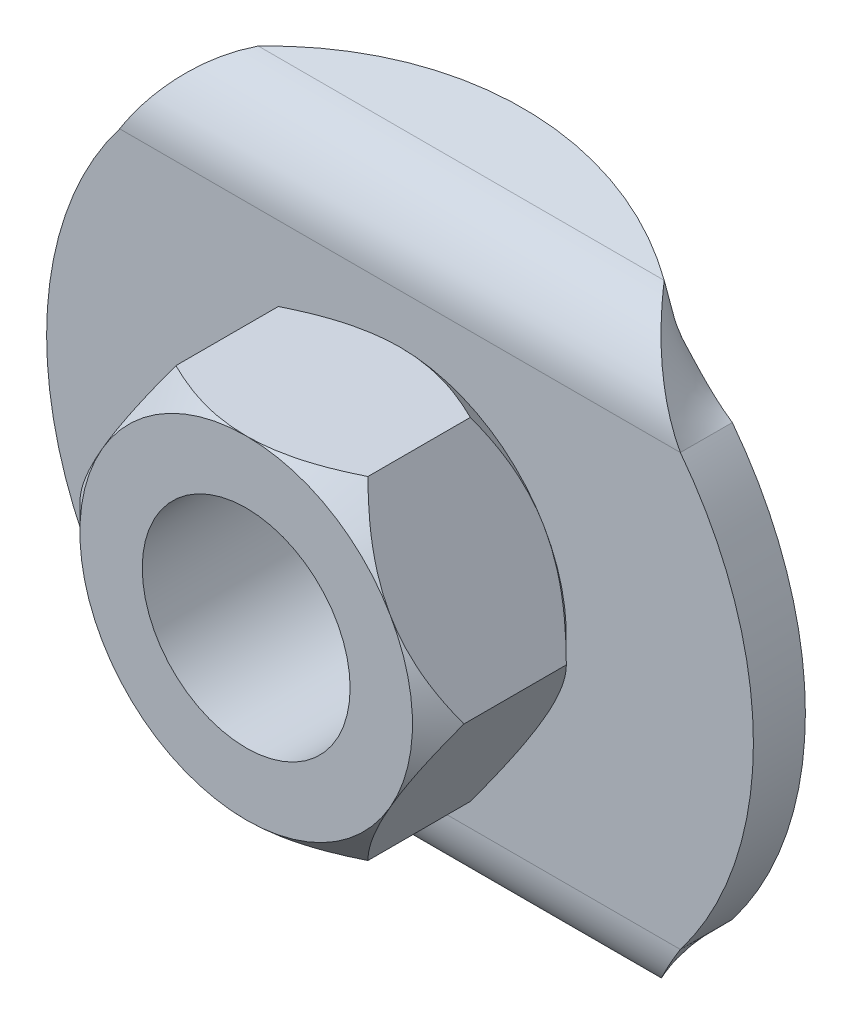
ISO-10303-21;
HEADER;
FILE_DESCRIPTION(('STEP AP214'),'2;1');
FILE_NAME('part.step','',(''),(''),'','','');
FILE_SCHEMA(('AUTOMOTIVE_DESIGN { 1 0 10303 214 1 1 1 1 }'));
ENDSEC;
DATA;
#1=APPLICATION_CONTEXT('core data for automotive mechanical design processes');
#2=APPLICATION_PROTOCOL_DEFINITION('international standard','automotive_design',2000,#1);
#3=PRODUCT_CONTEXT('',#1,'mechanical');
#4=PRODUCT('Part','Part','',(#3));
#5=PRODUCT_RELATED_PRODUCT_CATEGORY('part','',(#4));
#6=PRODUCT_DEFINITION_FORMATION('','',#4);
#7=PRODUCT_DEFINITION_CONTEXT('part definition',#1,'design');
#8=PRODUCT_DEFINITION('design','',#6,#7);
#9=PRODUCT_DEFINITION_SHAPE('','',#8);
#10=(LENGTH_UNIT() NAMED_UNIT(*) SI_UNIT(.MILLI.,.METRE.));
#11=(NAMED_UNIT(*) PLANE_ANGLE_UNIT() SI_UNIT($,.RADIAN.));
#12=(NAMED_UNIT(*) SI_UNIT($,.STERADIAN.) SOLID_ANGLE_UNIT());
#13=UNCERTAINTY_MEASURE_WITH_UNIT(LENGTH_MEASURE(1.E-05),#10,'distance_accuracy_value','');
#14=(GEOMETRIC_REPRESENTATION_CONTEXT(3) GLOBAL_UNCERTAINTY_ASSIGNED_CONTEXT((#13)) GLOBAL_UNIT_ASSIGNED_CONTEXT((#10,
#11,#12)) REPRESENTATION_CONTEXT('',''));
#15=CARTESIAN_POINT('',(0.,0.,0.));
#16=DIRECTION('',(0.,0.,1.));
#17=DIRECTION('',(1.,0.,0.));
#18=AXIS2_PLACEMENT_3D('',#15,#16,#17);
#19=CARTESIAN_POINT('',(0.,-5.29368429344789,6.49844166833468));
#20=DIRECTION('',(0.,0.96592582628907,-0.258819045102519));
#21=DIRECTION('',(0.,0.258819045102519,0.965925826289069));
#22=AXIS2_PLACEMENT_3D('',#19,#20,#21);
#23=PLANE('',#22);
#24=CARTESIAN_POINT('',(0.,-5.29368429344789,6.49844166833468));
#25=DIRECTION('',(0.,-0.96592582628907,0.258819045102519));
#26=DIRECTION('',(0.,-0.258819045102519,-0.965925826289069));
#27=AXIS2_PLACEMENT_3D('',#24,#25,#26);
#28=CIRCLE('',#27,8.5);
#29=CARTESIAN_POINT('',(4.88229601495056,-7.09453645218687,-0.22243008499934));
#30=VERTEX_POINT('',#29);
#31=CARTESIAN_POINT('',(-4.88229601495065,-7.09453645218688,-0.222430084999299));
#32=VERTEX_POINT('',#31);
#33=EDGE_CURVE('E710',#30,#32,#28,.F.);
#34=ORIENTED_EDGE('',*,*,#33,.F.);
#35=DIRECTION('',(-1.,0.,0.));
#36=VECTOR('',#35,1.);
#37=CARTESIAN_POINT('',(13.6598203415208,-7.09453645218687,-0.222430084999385));
#38=LINE('',#37,#36);
#39=EDGE_CURVE('E809',#32,#30,#38,.F.);
#40=ORIENTED_EDGE('',*,*,#39,.F.);
#41=EDGE_LOOP('',(#34,#40));
#42=FACE_BOUND('',#41,.T.);
#43=ADVANCED_FACE('F14',(#42),#23,.F.);
#44=CARTESIAN_POINT('',(0.,5.29368429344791,6.49844166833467));
#45=DIRECTION('',(0.,-0.965925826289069,-0.258819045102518));
#46=DIRECTION('',(0.,0.258819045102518,-0.965925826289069));
#47=AXIS2_PLACEMENT_3D('',#44,#45,#46);
#48=PLANE('',#47);
#49=CARTESIAN_POINT('',(0.,5.29368429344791,6.49844166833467));
#50=DIRECTION('',(0.,0.965925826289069,0.258819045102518));
#51=DIRECTION('',(0.,-0.258819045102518,0.965925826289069));
#52=AXIS2_PLACEMENT_3D('',#49,#50,#51);
#53=CIRCLE('',#52,8.5);
#54=CARTESIAN_POINT('',(-4.88229601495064,7.09453645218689,-0.222430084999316));
#55=VERTEX_POINT('',#54);
#56=CARTESIAN_POINT('',(4.88229601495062,7.09453645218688,-0.222430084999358));
#57=VERTEX_POINT('',#56);
#58=EDGE_CURVE('E339',#55,#57,#53,.F.);
#59=ORIENTED_EDGE('',*,*,#58,.F.);
#60=DIRECTION('',(1.,0.,0.));
#61=VECTOR('',#60,1.);
#62=CARTESIAN_POINT('',(-13.6598203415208,7.0945364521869,-0.222430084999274));
#63=LINE('',#62,#61);
#64=EDGE_CURVE('E806',#57,#55,#63,.F.);
#65=ORIENTED_EDGE('',*,*,#64,.F.);
#66=EDGE_LOOP('',(#59,#65));
#67=FACE_BOUND('',#66,.T.);
#68=ADVANCED_FACE('F654',(#67),#48,.F.);
#69=CARTESIAN_POINT('',(0.,4.08627701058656,6.17491786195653));
#70=DIRECTION('',(0.,0.965925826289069,0.258819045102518));
#71=DIRECTION('',(0.,-0.258819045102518,0.965925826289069));
#72=AXIS2_PLACEMENT_3D('',#69,#70,#71);
#73=CYLINDRICAL_SURFACE('',#72,8.5);
#74=DIRECTION('',(0.,0.965925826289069,0.258819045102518));
#75=VECTOR('',#74,1.);
#76=CARTESIAN_POINT('',(-4.88229601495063,5.88712916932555,-0.545953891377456));
#77=LINE('',#76,#75);
#78=CARTESIAN_POINT('',(-4.88229601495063,5.88712916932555,-0.545953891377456));
#79=VERTEX_POINT('',#78);
#80=EDGE_CURVE('E335',#79,#55,#77,.T.);
#81=ORIENTED_EDGE('',*,*,#80,.T.);
#82=ORIENTED_EDGE('',*,*,#58,.T.);
#83=DIRECTION('',(0.,-0.96592582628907,-0.258819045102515));
#84=VECTOR('',#83,1.);
#85=CARTESIAN_POINT('',(4.88229601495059,6.49083281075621,-0.384191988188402));
#86=LINE('',#85,#84);
#87=CARTESIAN_POINT('',(4.88229601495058,5.88712916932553,-0.545953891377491));
#88=VERTEX_POINT('',#87);
#89=EDGE_CURVE('E706',#57,#88,#86,.T.);
#90=ORIENTED_EDGE('',*,*,#89,.T.);
#91=CARTESIAN_POINT('',(0.,4.08627701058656,6.17491786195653));
#92=DIRECTION('',(0.,0.965925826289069,0.258819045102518));
#93=DIRECTION('',(0.,-0.258819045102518,0.965925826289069));
#94=AXIS2_PLACEMENT_3D('',#91,#92,#93);
#95=CIRCLE('',#94,8.5);
#96=EDGE_CURVE('E708',#79,#88,#95,.F.);
#97=ORIENTED_EDGE('',*,*,#96,.F.);
#98=EDGE_LOOP('',(#81,#82,#90,#97));
#99=FACE_BOUND('',#98,.T.);
#100=ADVANCED_FACE('F644',(#99),#73,.T.);
#101=CARTESIAN_POINT('',(0.,-4.08627701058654,6.17491786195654));
#102=DIRECTION('',(0.,-0.96592582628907,0.258819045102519));
#103=DIRECTION('',(0.,-0.258819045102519,-0.965925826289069));
#104=AXIS2_PLACEMENT_3D('',#101,#102,#103);
#105=CYLINDRICAL_SURFACE('',#104,8.5);
#106=DIRECTION('',(0.,-0.96592582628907,0.258819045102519));
#107=VECTOR('',#106,1.);
#108=CARTESIAN_POINT('',(4.88229601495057,-5.88712916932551,-0.545953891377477));
#109=LINE('',#108,#107);
#110=CARTESIAN_POINT('',(4.88229601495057,-5.88712916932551,-0.545953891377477));
#111=VERTEX_POINT('',#110);
#112=EDGE_CURVE('E812',#111,#30,#109,.T.);
#113=ORIENTED_EDGE('',*,*,#112,.T.);
#114=ORIENTED_EDGE('',*,*,#33,.T.);
#115=DIRECTION('',(0.,0.96592582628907,-0.258819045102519));
#116=VECTOR('',#115,1.);
#117=CARTESIAN_POINT('',(-4.88229601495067,-6.49083281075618,-0.384191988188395));
#118=LINE('',#117,#116);
#119=CARTESIAN_POINT('',(-4.88229601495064,-5.88712916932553,-0.545953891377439));
#120=VERTEX_POINT('',#119);
#121=EDGE_CURVE('E731',#32,#120,#118,.T.);
#122=ORIENTED_EDGE('',*,*,#121,.T.);
#123=CARTESIAN_POINT('',(0.,-4.08627701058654,6.17491786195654));
#124=DIRECTION('',(0.,-0.96592582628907,0.258819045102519));
#125=DIRECTION('',(0.,-0.258819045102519,-0.965925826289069));
#126=AXIS2_PLACEMENT_3D('',#123,#124,#125);
#127=CIRCLE('',#126,8.5);
#128=EDGE_CURVE('E732',#111,#120,#127,.F.);
#129=ORIENTED_EDGE('',*,*,#128,.F.);
#130=EDGE_LOOP('',(#113,#114,#122,#129));
#131=FACE_BOUND('',#130,.T.);
#132=ADVANCED_FACE('F634',(#131),#105,.T.);
#133=CARTESIAN_POINT('',(13.6598203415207,-5.17562820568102,-0.736600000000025));
#134=DIRECTION('',(-1.,0.,0.));
#135=DIRECTION('',(0.,1.,0.));
#136=AXIS2_PLACEMENT_3D('',#133,#134,#135);
#137=CYLINDRICAL_SURFACE('',#136,1.9866);
#138=ORIENTED_EDGE('',*,*,#39,.T.);
#139=CARTESIAN_POINT('',(4.88229601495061,-7.09453645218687,-0.22243008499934));
#140=CARTESIAN_POINT('',(4.91238354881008,-7.08584627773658,-0.189987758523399));
#141=CARTESIAN_POINT('',(4.94217287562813,-7.07626104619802,-0.157516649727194));
#142=CARTESIAN_POINT('',(5.00123284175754,-7.05528489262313,-0.0926832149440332));
#143=CARTESIAN_POINT('',(5.03050345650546,-7.04389388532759,-0.0603208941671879));
#144=CARTESIAN_POINT('',(5.11765260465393,-7.00698892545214,0.0363520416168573));
#145=CARTESIAN_POINT('',(5.17486536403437,-6.9787439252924,0.100245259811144));
#146=CARTESIAN_POINT('',(5.28767309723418,-6.91497430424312,0.225799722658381));
#147=CARTESIAN_POINT('',(5.34326781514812,-6.87944853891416,0.287460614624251));
#148=CARTESIAN_POINT('',(5.45310798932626,-6.80134052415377,0.407410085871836));
#149=CARTESIAN_POINT('',(5.50735367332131,-6.75875947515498,0.46569923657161));
#150=CARTESIAN_POINT('',(5.6143178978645,-6.66731165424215,0.577414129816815));
#151=CARTESIAN_POINT('',(5.66704529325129,-6.61849906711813,0.630875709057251));
#152=CARTESIAN_POINT('',(5.77142396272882,-6.51472019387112,0.732647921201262));
#153=CARTESIAN_POINT('',(5.82307515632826,-6.45975344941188,0.78095816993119));
#154=CARTESIAN_POINT('',(5.92541395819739,-6.344438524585,0.871449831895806));
#155=CARTESIAN_POINT('',(5.97610333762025,-6.28410170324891,0.913643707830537));
#156=CARTESIAN_POINT('',(6.07675924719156,-6.15868049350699,0.991297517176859));
#157=CARTESIAN_POINT('',(6.12672582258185,-6.09359640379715,1.02675787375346));
#158=CARTESIAN_POINT('',(6.22452036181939,-5.96123521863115,1.08949250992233));
#159=CARTESIAN_POINT('',(6.27236934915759,-5.89406766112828,1.11696510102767));
#160=CARTESIAN_POINT('',(6.36743961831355,-5.75673357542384,1.16449886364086));
#161=CARTESIAN_POINT('',(6.41466092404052,-5.68656716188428,1.18456031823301));
#162=CARTESIAN_POINT('',(6.50896208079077,-5.54361222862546,1.21700585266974));
#163=CARTESIAN_POINT('',(6.55603830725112,-5.47080816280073,1.22933209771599));
#164=CARTESIAN_POINT('',(6.6497013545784,-5.32393686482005,1.2458392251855));
#165=CARTESIAN_POINT('',(6.69628799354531,-5.2498691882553,1.25001717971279));
#166=CARTESIAN_POINT('',(6.74261615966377,-5.17562820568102,1.24999999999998));
#167=B_SPLINE_CURVE_WITH_KNOTS('',3,(#139,#140,#141,#142,#143,#144,#145,#146,#147,#148,#149,
#150,#151,#152,#153,#154,#155,#156,#157,#158,#159,#160,#161,#162,#163,#164,#165,#166),
.UNSPECIFIED.,.F.,.F.,(4,2,2,2,2,2,2,2,2,2,2,2,2,4),(0.,0.135254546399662,0.270515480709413,
0.541051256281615,0.811629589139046,1.08216193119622,1.35048448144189,1.61882702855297,
1.88661487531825,2.15438588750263,2.41479271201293,2.67518958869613,2.9375109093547,
3.19992647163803),.UNSPECIFIED.);
#168=CARTESIAN_POINT('',(6.74261615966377,-5.17562820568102,1.24999999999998));
#169=VERTEX_POINT('',#168);
#170=EDGE_CURVE('E795',#30,#169,#167,.T.);
#171=ORIENTED_EDGE('',*,*,#170,.T.);
#172=DIRECTION('',(1.,0.,0.));
#173=VECTOR('',#172,1.);
#174=CARTESIAN_POINT('',(0.,-5.175628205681,1.25000000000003));
#175=LINE('',#174,#173);
#176=CARTESIAN_POINT('',(-6.7426161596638,-5.17562820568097,1.25000000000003));
#177=VERTEX_POINT('',#176);
#178=EDGE_CURVE('E792',#169,#177,#175,.F.);
#179=ORIENTED_EDGE('',*,*,#178,.T.);
#180=CARTESIAN_POINT('',(-6.7426161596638,-5.17562820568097,1.25000000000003));
#181=CARTESIAN_POINT('',(-6.70744846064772,-5.23958436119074,1.24999731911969));
#182=CARTESIAN_POINT('',(-6.6712604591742,-5.30294606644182,1.24691219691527));
#183=CARTESIAN_POINT('',(-6.59722359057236,-5.42807008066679,1.23489738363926));
#184=CARTESIAN_POINT('',(-6.55937592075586,-5.48983349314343,1.22597184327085));
#185=CARTESIAN_POINT('',(-6.48249199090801,-5.61121576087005,1.20263914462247));
#186=CARTESIAN_POINT('',(-6.44346068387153,-5.67084174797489,1.18825253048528));
#187=CARTESIAN_POINT('',(-6.36434927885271,-5.78788810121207,1.15428079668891));
#188=CARTESIAN_POINT('',(-6.32426897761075,-5.84530803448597,1.1346946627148));
#189=CARTESIAN_POINT('',(-6.24250198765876,-5.95846895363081,1.09028099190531));
#190=CARTESIAN_POINT('',(-6.20079974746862,-6.01416712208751,1.06537297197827));
#191=CARTESIAN_POINT('',(-6.11657666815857,-6.12253890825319,1.01086189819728));
#192=CARTESIAN_POINT('',(-6.07405587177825,-6.17521268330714,0.981259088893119));
#193=CARTESIAN_POINT('',(-5.94542710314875,-6.32840234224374,0.885791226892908));
#194=CARTESIAN_POINT('',(-5.85829983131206,-6.42402125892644,0.81329280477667));
#195=CARTESIAN_POINT('',(-5.67105594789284,-6.61026021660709,0.644019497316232));
#196=CARTESIAN_POINT('',(-5.57064138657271,-6.69888194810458,0.545370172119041));
#197=CARTESIAN_POINT('',(-5.41871866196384,-6.81534067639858,0.386890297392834));
#198=CARTESIAN_POINT('',(-5.3678538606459,-6.85141843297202,0.332304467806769));
#199=CARTESIAN_POINT('',(-5.26563019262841,-6.91785298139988,0.220203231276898));
#200=CARTESIAN_POINT('',(-5.21427149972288,-6.94821171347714,0.162688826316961));
#201=CARTESIAN_POINT('',(-5.11624151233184,-7.0002903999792,0.0511745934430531));
#202=CARTESIAN_POINT('',(-5.06961344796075,-7.02256989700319,-0.00260386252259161));
#203=CARTESIAN_POINT('',(-4.97613267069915,-7.06222543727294,-0.111550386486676));
#204=CARTESIAN_POINT('',(-4.92928059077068,-7.07961116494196,-0.166715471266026));
#205=CARTESIAN_POINT('',(-4.88229601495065,-7.09453645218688,-0.222430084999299));
#206=B_SPLINE_CURVE_WITH_KNOTS('',3,(#180,#181,#182,#183,#184,#185,#186,#187,#188,#189,#190,
#191,#192,#193,#194,#195,#196,#197,#198,#199,#200,#201,#202,#203,#204,#205),.UNSPECIFIED.,.F.,
.F.,(4,2,2,2,2,2,2,2,2,2,2,2,4),(0.,0.218845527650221,0.437535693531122,0.655411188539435,
0.873329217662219,1.09481124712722,1.3162817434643,1.75947396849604,2.25618982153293,
2.50461603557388,2.75295781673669,2.97653752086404,3.1996716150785),.UNSPECIFIED.);
#207=EDGE_CURVE('E724',#177,#32,#206,.T.);
#208=ORIENTED_EDGE('',*,*,#207,.T.);
#209=EDGE_LOOP('',(#138,#171,#179,#208));
#210=FACE_BOUND('',#209,.T.);
#211=ADVANCED_FACE('F624',(#210),#137,.T.);
#212=CARTESIAN_POINT('',(-13.6598203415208,5.17562820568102,-0.736599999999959));
#213=DIRECTION('',(1.,0.,0.));
#214=DIRECTION('',(0.,0.,1.));
#215=AXIS2_PLACEMENT_3D('',#212,#213,#214);
#216=CYLINDRICAL_SURFACE('',#215,1.9866);
#217=ORIENTED_EDGE('',*,*,#64,.T.);
#218=CARTESIAN_POINT('',(-4.88229601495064,7.09453645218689,-0.222430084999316));
#219=CARTESIAN_POINT('',(-4.91238241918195,7.08584660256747,-0.18998896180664));
#220=CARTESIAN_POINT('',(-4.94217051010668,7.07626172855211,-0.157518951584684));
#221=CARTESIAN_POINT('',(-5.00122786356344,7.055286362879,-0.0926875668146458));
#222=CARTESIAN_POINT('',(-5.03049710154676,7.04389578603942,-0.0603261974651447));
#223=CARTESIAN_POINT('',(-5.11764200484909,7.00699224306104,0.0363439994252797));
#224=CARTESIAN_POINT('',(-5.17485179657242,6.97874835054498,0.100235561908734));
#225=CARTESIAN_POINT('',(-5.28765346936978,6.91498133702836,0.225786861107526));
#226=CARTESIAN_POINT('',(-5.34324509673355,6.87945708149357,0.287446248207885));
#227=CARTESIAN_POINT('',(-5.45307934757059,6.80135256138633,0.407392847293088));
#228=CARTESIAN_POINT('',(-5.50732219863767,6.75877349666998,0.465680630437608));
#229=CARTESIAN_POINT('',(-5.61428184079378,6.66732945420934,0.577393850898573));
#230=CARTESIAN_POINT('',(-5.66700746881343,6.61851856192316,0.630855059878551));
#231=CARTESIAN_POINT('',(-5.77138285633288,6.51474336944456,0.732626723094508));
#232=CARTESIAN_POINT('',(-5.82303253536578,6.45977861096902,0.780936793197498));
#233=CARTESIAN_POINT('',(-5.92536875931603,6.34446795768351,0.87142836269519));
#234=CARTESIAN_POINT('',(-5.97605707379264,6.28413341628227,0.913622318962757));
#235=CARTESIAN_POINT('',(-6.0767112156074,6.15871706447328,0.991276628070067));
#236=CARTESIAN_POINT('',(-6.1266770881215,6.09363555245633,1.02673740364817));
#237=CARTESIAN_POINT('',(-6.22447469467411,5.96127404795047,1.08947596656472));
#238=CARTESIAN_POINT('',(-6.27232738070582,5.89410325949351,1.11695145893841));
#239=CARTESIAN_POINT('',(-6.36740529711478,5.75676243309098,1.16449019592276));
#240=CARTESIAN_POINT('',(-6.41463055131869,5.68659250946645,1.18455372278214));
#241=CARTESIAN_POINT('',(-6.50893991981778,5.54363041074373,1.21700257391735));
#242=CARTESIAN_POINT('',(-6.55602041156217,5.47082268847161,1.22933005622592));
#243=CARTESIAN_POINT('',(-6.64969223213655,5.32394409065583,1.24583882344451));
#244=CARTESIAN_POINT('',(-6.69628337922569,5.24987277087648,1.25001718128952));
#245=CARTESIAN_POINT('',(-6.74261615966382,5.17562820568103,1.25000000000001));
#246=B_SPLINE_CURVE_WITH_KNOTS('',3,(#218,#219,#220,#221,#222,#223,#224,#225,#226,#227,#228,
#229,#230,#231,#232,#233,#234,#235,#236,#237,#238,#239,#240,#241,#242,#243,#244,#245),
.UNSPECIFIED.,.F.,.F.,(4,2,2,2,2,2,2,2,2,2,2,2,2,4),(0.,0.135249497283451,0.27050537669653,
0.541030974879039,0.811598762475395,1.08212058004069,1.3504365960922,1.61877260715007,
1.88655417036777,2.15431891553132,2.41474202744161,2.67515522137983,2.93749301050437,
3.19992501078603),.UNSPECIFIED.);
#247=CARTESIAN_POINT('',(-6.74261615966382,5.17562820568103,1.25000000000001));
#248=VERTEX_POINT('',#247);
#249=EDGE_CURVE('E715',#55,#248,#246,.T.);
#250=ORIENTED_EDGE('',*,*,#249,.T.);
#251=DIRECTION('',(1.,0.,0.));
#252=VECTOR('',#251,1.);
#253=CARTESIAN_POINT('',(0.,5.175628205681,1.25000000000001));
#254=LINE('',#253,#252);
#255=CARTESIAN_POINT('',(6.7426161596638,5.17562820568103,1.25000000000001));
#256=VERTEX_POINT('',#255);
#257=EDGE_CURVE('E786',#248,#256,#254,.T.);
#258=ORIENTED_EDGE('',*,*,#257,.T.);
#259=CARTESIAN_POINT('',(6.7426161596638,5.17562820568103,1.25000000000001));
#260=CARTESIAN_POINT('',(6.70744727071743,5.23958502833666,1.24999732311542));
#261=CARTESIAN_POINT('',(6.67125823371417,5.30294747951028,1.24691213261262));
#262=CARTESIAN_POINT('',(6.59721949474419,5.42807307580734,1.23489702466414));
#263=CARTESIAN_POINT('',(6.55937098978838,5.48983732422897,1.2259712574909));
#264=CARTESIAN_POINT('',(6.48248548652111,5.61122127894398,1.20263793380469));
#265=CARTESIAN_POINT('',(6.44345344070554,5.67084811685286,1.18825092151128));
#266=CARTESIAN_POINT('',(6.36434061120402,5.78789613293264,1.15427822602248));
#267=CARTESIAN_POINT('',(6.32425962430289,5.84531687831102,1.13469152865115));
#268=CARTESIAN_POINT('',(6.24249134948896,5.9584792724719,1.09027659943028));
#269=CARTESIAN_POINT('',(6.20078851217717,6.01417810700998,1.06536789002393));
#270=CARTESIAN_POINT('',(6.11656424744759,6.12255112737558,1.01085530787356));
#271=CARTESIAN_POINT('',(6.07404286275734,6.17522547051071,0.981251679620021));
#272=CARTESIAN_POINT('',(5.94541232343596,6.32841663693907,0.885781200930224));
#273=CARTESIAN_POINT('',(5.85828385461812,6.42403630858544,0.813280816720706));
#274=CARTESIAN_POINT('',(5.6710387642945,6.61027486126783,0.644004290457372));
#275=CARTESIAN_POINT('',(5.57062422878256,6.69889562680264,0.545353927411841));
#276=CARTESIAN_POINT('',(5.418701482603,6.81535274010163,0.386872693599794));
#277=CARTESIAN_POINT('',(5.36783666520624,6.85142992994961,0.332286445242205));
#278=CARTESIAN_POINT('',(5.26561295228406,6.91786330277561,0.220184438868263));
#279=CARTESIAN_POINT('',(5.21425423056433,6.94822142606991,0.162669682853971));
#280=CARTESIAN_POINT('',(5.1162270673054,7.00029739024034,0.0511581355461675));
#281=CARTESIAN_POINT('',(5.06960187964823,7.02257507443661,-0.00261717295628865));
#282=CARTESIAN_POINT('',(4.97612687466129,7.06222758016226,-0.111557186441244));
#283=CARTESIAN_POINT('',(4.92927769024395,7.07961208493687,-0.166718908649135));
#284=CARTESIAN_POINT('',(4.88229601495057,7.09453645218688,-0.222430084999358));
#285=B_SPLINE_CURVE_WITH_KNOTS('',3,(#259,#260,#261,#262,#263,#264,#265,#266,#267,#268,#269,
#270,#271,#272,#273,#274,#275,#276,#277,#278,#279,#280,#281,#282,#283,#284),.UNSPECIFIED.,.F.,
.F.,(4,2,2,2,2,2,2,2,2,2,2,2,4),(0.,0.218849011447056,0.437542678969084,0.655421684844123,
0.873343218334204,1.09482845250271,1.31630215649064,1.75950074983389,2.25621685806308,
2.50464318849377,2.75298508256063,2.97655099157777,3.1996713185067),.UNSPECIFIED.);
#286=EDGE_CURVE('E698',#256,#57,#285,.T.);
#287=ORIENTED_EDGE('',*,*,#286,.T.);
#288=EDGE_LOOP('',(#217,#250,#258,#287));
#289=FACE_BOUND('',#288,.T.);
#290=ADVANCED_FACE('F614',(#289),#216,.T.);
#291=CARTESIAN_POINT('',(4.88229601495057,7.10673126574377,-0.219162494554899));
#292=CARTESIAN_POINT('',(5.10335069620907,7.03603565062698,0.0446771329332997));
#293=CARTESIAN_POINT('',(5.30754082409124,6.9149958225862,0.279158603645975));
#294=CARTESIAN_POINT('',(5.68341786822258,6.61757465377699,0.669798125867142));
#295=CARTESIAN_POINT('',(5.85490046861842,6.44158956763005,0.826026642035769));
#296=CARTESIAN_POINT('',(6.16495382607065,6.07491280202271,1.06221833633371));
#297=CARTESIAN_POINT('',(6.30352458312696,5.88431417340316,1.1425012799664));
#298=CARTESIAN_POINT('',(6.54775425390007,5.5163327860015,1.24258614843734));
#299=CARTESIAN_POINT('',(6.65348876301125,5.33875803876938,1.26262499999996));
#300=CARTESIAN_POINT('',(6.74261615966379,5.17562820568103,1.26262499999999));
#301=CARTESIAN_POINT('',(4.88229601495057,7.09453645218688,-0.222430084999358));
#302=CARTESIAN_POINT('',(5.1033492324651,7.0242874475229,0.0397427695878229));
#303=CARTESIAN_POINT('',(5.30754082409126,6.9040118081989,0.272744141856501));
#304=CARTESIAN_POINT('',(5.68341786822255,6.60846883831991,0.660916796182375));
#305=CARTESIAN_POINT('',(5.85490046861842,6.43359508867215,0.816158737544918));
#306=CARTESIAN_POINT('',(6.16495382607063,6.06923386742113,1.05085889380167));
#307=CARTESIAN_POINT('',(6.30352458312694,5.8798388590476,1.1306348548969));
#308=CARTESIAN_POINT('',(6.54775425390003,5.51418125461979,1.23008769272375));
#309=CARTESIAN_POINT('',(6.65348831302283,5.33772818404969,1.25));
#310=CARTESIAN_POINT('',(6.7426161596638,5.17562820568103,1.25000000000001));
#311=CARTESIAN_POINT('',(4.88229601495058,5.88712916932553,-0.545953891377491));
#312=CARTESIAN_POINT('',(5.10320430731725,5.86109902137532,-0.448808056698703));
#313=CARTESIAN_POINT('',(5.30754082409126,5.8164856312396,-0.362351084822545));
#314=CARTESIAN_POINT('',(5.68341786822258,5.70690295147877,-0.218422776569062));
#315=CARTESIAN_POINT('',(5.85490046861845,5.6420625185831,-0.160861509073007));
#316=CARTESIAN_POINT('',(6.16495382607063,5.50696311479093,-0.0738383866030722));
#317=CARTESIAN_POINT('',(6.30352458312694,5.43673842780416,-0.0442587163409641));
#318=CARTESIAN_POINT('',(6.54775425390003,5.30115834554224,-0.00738317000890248));
#319=CARTESIAN_POINT('',(6.65344375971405,5.23576237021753,0.));
#320=CARTESIAN_POINT('',(6.74261615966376,5.17562820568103,0.));
#321=CARTESIAN_POINT('',(4.88229601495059,5.87505509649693,-0.549189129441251));
#322=CARTESIAN_POINT('',(5.1032028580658,5.84946713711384,-0.453693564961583));
#323=CARTESIAN_POINT('',(5.30754082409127,5.80561036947,-0.368702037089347));
#324=CARTESIAN_POINT('',(5.68341786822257,5.69788729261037,-0.227216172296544));
#325=CARTESIAN_POINT('',(5.85490046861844,5.6341471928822,-0.170631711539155));
#326=CARTESIAN_POINT('',(6.16495382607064,5.50134040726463,-0.0850853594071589));
#327=CARTESIAN_POINT('',(6.30352458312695,5.43230742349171,-0.0560076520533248));
#328=CARTESIAN_POINT('',(6.54775425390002,5.29902811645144,-0.0197578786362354));
#329=CARTESIAN_POINT('',(6.65344331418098,5.23474271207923,-0.012500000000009));
#330=CARTESIAN_POINT('',(6.74261615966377,5.17562820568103,-0.012500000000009));
#331=B_SPLINE_SURFACE_WITH_KNOTS('',1,3,((#291,#292,#293,#294,#295,#296,#297,#298,#299,#300),
(#301,#302,#303,#304,#305,#306,#307,#308,#309,#310),(#311,#312,#313,#314,#315,#316,#317,#318,
#319,#320),(#321,#322,#323,#324,#325,#326,#327,#328,#329,#330)),.UNSPECIFIED.,.F.,.F.,.F.,(2,1,
1,2),(4,2,2,2,4),(-0.0101,0.,1.,1.01),(0.,0.25,0.5,0.75,1.),.UNSPECIFIED.);
#332=DIRECTION('',(0.,0.,1.));
#333=VECTOR('',#332,1.);
#334=CARTESIAN_POINT('',(6.74261615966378,5.17562820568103,0.624999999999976));
#335=LINE('',#334,#333);
#336=CARTESIAN_POINT('',(6.74261615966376,5.17562820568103,0.));
#337=VERTEX_POINT('',#336);
#338=EDGE_CURVE('E707',#337,#256,#335,.T.);
#339=CARTESIAN_POINT('',(6.74261615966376,5.17562820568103,0.));
#340=CARTESIAN_POINT('',(6.7166879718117,5.19310852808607,-4.24130900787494E-06));
#341=CARTESIAN_POINT('',(6.69054133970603,5.21024932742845,-0.000621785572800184));
#342=CARTESIAN_POINT('',(6.63789567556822,5.24388372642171,-0.00297465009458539));
#343=CARTESIAN_POINT('',(6.61139676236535,5.26037753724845,-0.00470960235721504));
#344=CARTESIAN_POINT('',(6.53154229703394,5.30891064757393,-0.0114222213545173));
#345=CARTESIAN_POINT('',(6.47776061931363,5.34004727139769,-0.0179082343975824));
#346=CARTESIAN_POINT('',(6.36978279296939,5.39992213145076,-0.0342989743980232));
#347=CARTESIAN_POINT('',(6.31559025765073,5.42867200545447,-0.0441857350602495));
#348=CARTESIAN_POINT('',(6.20663436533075,5.4838618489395,-0.0669254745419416));
#349=CARTESIAN_POINT('',(6.15187082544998,5.51030105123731,-0.0797794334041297));
#350=CARTESIAN_POINT('',(6.04798149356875,5.55806905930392,-0.10653423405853));
#351=CARTESIAN_POINT('',(5.99889681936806,5.57964024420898,-0.120165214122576));
#352=CARTESIAN_POINT('',(5.90048988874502,5.62088349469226,-0.149264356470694));
#353=CARTESIAN_POINT('',(5.85116767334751,5.64055587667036,-0.164732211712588));
#354=CARTESIAN_POINT('',(5.70267539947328,5.69665245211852,-0.213552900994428));
#355=CARTESIAN_POINT('',(5.60313709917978,5.73008323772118,-0.249280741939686));
#356=CARTESIAN_POINT('',(5.40021700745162,5.78968154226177,-0.326752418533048));
#357=CARTESIAN_POINT('',(5.29681610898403,5.81557531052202,-0.368654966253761));
#358=CARTESIAN_POINT('',(5.14146333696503,5.84753499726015,-0.433769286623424));
#359=CARTESIAN_POINT('',(5.08970610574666,5.85703332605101,-0.455820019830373));
#360=CARTESIAN_POINT('',(4.98608141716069,5.87377124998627,-0.500499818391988));
#361=CARTESIAN_POINT('',(4.93421397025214,5.88101105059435,-0.52312883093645));
#362=CARTESIAN_POINT('',(4.88229601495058,5.88712916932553,-0.545953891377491));
#363=B_SPLINE_CURVE_WITH_KNOTS('',3,(#339,#340,#341,#342,#343,#344,#345,#346,#347,#348,#349,
#350,#351,#352,#353,#354,#355,#356,#357,#358,#359,#360,#361,#362),.UNSPECIFIED.,.F.,.F.,(4,2,2,
2,2,2,2,2,2,2,2,4),(0.,0.0937885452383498,0.187546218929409,0.374815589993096,0.561110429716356,
0.747466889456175,0.913364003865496,1.07923342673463,1.41150552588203,1.75466031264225,
1.92578360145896,2.0968913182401),.UNSPECIFIED.);
#364=EDGE_CURVE('E690',#337,#88,#363,.T.);
#365=ORIENTED_EDGE('',*,*,#286,.F.);
#366=ORIENTED_EDGE('',*,*,#338,.F.);
#367=ORIENTED_EDGE('',*,*,#364,.T.);
#368=ORIENTED_EDGE('',*,*,#89,.F.);
#369=EDGE_LOOP('',(#365,#366,#367,#368));
#370=FACE_BOUND('',#369,.T.);
#371=ADVANCED_FACE('F604',(#370),#331,.F.);
#372=CARTESIAN_POINT('',(0.,4.08627701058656,6.17491786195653));
#373=DIRECTION('',(0.,-0.965925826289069,-0.258819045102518));
#374=DIRECTION('',(0.,0.258819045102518,-0.965925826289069));
#375=AXIS2_PLACEMENT_3D('',#372,#373,#374);
#376=PLANE('',#375);
#377=ORIENTED_EDGE('',*,*,#96,.T.);
#378=DIRECTION('',(1.,0.,0.));
#379=VECTOR('',#378,1.);
#380=CARTESIAN_POINT('',(-13.6598203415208,5.88712916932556,-0.545953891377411));
#381=LINE('',#380,#379);
#382=EDGE_CURVE('E773',#88,#79,#381,.F.);
#383=ORIENTED_EDGE('',*,*,#382,.T.);
#384=EDGE_LOOP('',(#377,#383));
#385=FACE_BOUND('',#384,.T.);
#386=ADVANCED_FACE('F594',(#385),#376,.T.);
#387=CARTESIAN_POINT('',(-6.74261615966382,5.17562820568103,1.26262500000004));
#388=CARTESIAN_POINT('',(-6.56288751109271,5.46554670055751,1.26262500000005));
#389=CARTESIAN_POINT('',(-6.38979392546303,5.73518080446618,1.1994295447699));
#390=CARTESIAN_POINT('',(-6.05530120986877,6.20117111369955,0.998211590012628));
#391=CARTESIAN_POINT('',(-5.89416469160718,6.39752092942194,0.860722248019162));
#392=CARTESIAN_POINT('',(-5.58411133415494,6.71316777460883,0.55971487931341));
#393=CARTESIAN_POINT('',(-5.43519449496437,6.83291183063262,0.396348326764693));
#394=CARTESIAN_POINT('',(-5.14958049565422,7.01055189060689,0.0777807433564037));
#395=CARTESIAN_POINT('',(-5.01278005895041,7.06880102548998,-0.0776049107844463));
#396=CARTESIAN_POINT('',(-4.88229601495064,7.10673126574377,-0.219162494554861));
#397=CARTESIAN_POINT('',(-6.74261615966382,5.17562820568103,1.25000000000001));
#398=CARTESIAN_POINT('',(-6.56288919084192,5.46371488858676,1.25000000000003));
#399=CARTESIAN_POINT('',(-6.38979392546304,5.73164725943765,1.18720362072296));
#400=CARTESIAN_POINT('',(-6.05530120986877,6.19469486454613,0.987256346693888));
#401=CARTESIAN_POINT('',(-5.89416469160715,6.38980474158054,0.850635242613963));
#402=CARTESIAN_POINT('',(-5.58411133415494,6.70345829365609,0.551528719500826));
#403=CARTESIAN_POINT('',(-5.43519449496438,6.82244617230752,0.389193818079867));
#404=CARTESIAN_POINT('',(-5.14958049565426,6.99896444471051,0.072637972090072));
#405=CARTESIAN_POINT('',(-5.01278082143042,7.05684565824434,-0.081766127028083));
#406=CARTESIAN_POINT('',(-4.88229601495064,7.09453645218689,-0.222430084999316));
#407=CARTESIAN_POINT('',(-6.74261615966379,5.17562820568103,0.));
#408=CARTESIAN_POINT('',(-6.56305550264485,5.28234736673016,0.));
#409=CARTESIAN_POINT('',(-6.38979392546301,5.38179131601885,-0.0232839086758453));
#410=CARTESIAN_POINT('',(-6.05530120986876,5.55348207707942,-0.0974212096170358));
#411=CARTESIAN_POINT('',(-5.89416469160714,5.6258257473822,-0.14807816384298));
#412=CARTESIAN_POINT('',(-5.58411133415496,5.74212354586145,-0.258982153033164));
#413=CARTESIAN_POINT('',(-5.43519449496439,5.78624237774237,-0.31917337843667));
#414=CARTESIAN_POINT('',(-5.14958049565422,5.85169257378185,-0.436547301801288));
#415=CARTESIAN_POINT('',(-5.01285631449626,5.87314593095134,-0.493767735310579));
#416=CARTESIAN_POINT('',(-4.88229601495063,5.88712916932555,-0.545953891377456));
#417=CARTESIAN_POINT('',(-6.74261615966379,5.17562820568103,-0.012499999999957));
#418=CARTESIAN_POINT('',(-6.56305716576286,5.28053369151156,-0.0124999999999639));
#419=CARTESIAN_POINT('',(-6.38979392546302,5.37829275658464,-0.0353887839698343));
#420=CARTESIAN_POINT('',(-6.05530120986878,5.54706994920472,-0.108267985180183));
#421=CARTESIAN_POINT('',(-5.89416469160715,5.6181859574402,-0.158065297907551));
#422=CARTESIAN_POINT('',(-5.58411133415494,5.73251019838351,-0.267087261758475));
#423=CARTESIAN_POINT('',(-5.43519449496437,5.77588033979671,-0.326257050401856));
#424=CARTESIAN_POINT('',(-5.14958049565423,5.84021985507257,-0.441639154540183));
#425=CARTESIAN_POINT('',(-5.01285706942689,5.86130893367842,-0.497887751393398));
#426=CARTESIAN_POINT('',(-4.88229601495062,5.87505509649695,-0.549189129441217));
#427=B_SPLINE_SURFACE_WITH_KNOTS('',1,3,((#387,#388,#389,#390,#391,#392,#393,#394,#395,#396),
(#397,#398,#399,#400,#401,#402,#403,#404,#405,#406),(#407,#408,#409,#410,#411,#412,#413,#414,
#415,#416),(#417,#418,#419,#420,#421,#422,#423,#424,#425,#426)),.UNSPECIFIED.,.F.,.F.,.F.,(2,1,
1,2),(4,2,2,2,4),(-0.0101,0.,1.,1.01),(0.,0.25,0.5,0.75,1.),.UNSPECIFIED.);
#428=CARTESIAN_POINT('',(-4.88229601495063,5.88712916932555,-0.545953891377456));
#429=CARTESIAN_POINT('',(-4.93270343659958,5.88173454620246,-0.525786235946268));
#430=CARTESIAN_POINT('',(-4.98290166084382,5.8753331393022,-0.5053585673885));
#431=CARTESIAN_POINT('',(-5.08292033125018,5.86040654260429,-0.464329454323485));
#432=CARTESIAN_POINT('',(-5.13274070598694,5.85188096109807,-0.443727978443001));
#433=CARTESIAN_POINT('',(-5.23205557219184,5.83259191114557,-0.402692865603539));
#434=CARTESIAN_POINT('',(-5.2815498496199,5.82182709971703,-0.382259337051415));
#435=CARTESIAN_POINT('',(-5.38017819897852,5.79799052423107,-0.341894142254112));
#436=CARTESIAN_POINT('',(-5.42931230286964,5.78491896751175,-0.32196243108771));
#437=CARTESIAN_POINT('',(-5.56264484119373,5.74626000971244,-0.268964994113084));
#438=CARTESIAN_POINT('',(-5.64657029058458,5.71844601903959,-0.236796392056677));
#439=CARTESIAN_POINT('',(-5.81347353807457,5.65631487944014,-0.176801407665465));
#440=CARTESIAN_POINT('',(-5.89645216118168,5.62200393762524,-0.148970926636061));
#441=CARTESIAN_POINT('',(-6.04327364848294,5.55613721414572,-0.104936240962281));
#442=CARTESIAN_POINT('',(-6.10724897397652,5.52567915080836,-0.0875237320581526));
#443=CARTESIAN_POINT('',(-6.23477291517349,5.46183847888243,-0.0569588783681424));
#444=CARTESIAN_POINT('',(-6.29832149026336,5.42845559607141,-0.0438069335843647));
#445=CARTESIAN_POINT('',(-6.42550391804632,5.35926248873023,-0.0223324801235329));
#446=CARTESIAN_POINT('',(-6.48913528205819,5.32343697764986,-0.0140442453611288));
#447=CARTESIAN_POINT('',(-6.61609911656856,5.25037819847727,-0.00286394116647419));
#448=CARTESIAN_POINT('',(-6.67943143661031,5.21314429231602,2.56518165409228E-05));
#449=CARTESIAN_POINT('',(-6.74261615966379,5.17562820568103,0.));
#450=B_SPLINE_CURVE_WITH_KNOTS('',3,(#428,#429,#430,#431,#432,#433,#434,#435,#436,#437,#438,
#439,#440,#441,#442,#443,#444,#445,#446,#447,#448,#449),.UNSPECIFIED.,.F.,.F.,(4,2,2,2,2,2,2,2,
2,2,4),(0.,0.163672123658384,0.327374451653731,0.491175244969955,0.654961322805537,
0.936894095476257,1.21855885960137,1.43728077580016,1.65602322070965,1.87628915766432,
2.09665610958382),.UNSPECIFIED.);
#451=CARTESIAN_POINT('',(-6.74261615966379,5.17562820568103,0.));
#452=VERTEX_POINT('',#451);
#453=EDGE_CURVE('E767',#79,#452,#450,.T.);
#454=DIRECTION('',(0.,0.,-1.));
#455=VECTOR('',#454,1.);
#456=CARTESIAN_POINT('',(-6.74261615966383,5.17562820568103,0.625000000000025));
#457=LINE('',#456,#455);
#458=EDGE_CURVE('E723',#248,#452,#457,.T.);
#459=ORIENTED_EDGE('',*,*,#80,.F.);
#460=ORIENTED_EDGE('',*,*,#453,.T.);
#461=ORIENTED_EDGE('',*,*,#458,.F.);
#462=ORIENTED_EDGE('',*,*,#249,.F.);
#463=EDGE_LOOP('',(#459,#460,#461,#462));
#464=FACE_BOUND('',#463,.T.);
#465=ADVANCED_FACE('F584',(#464),#427,.F.);
#466=CARTESIAN_POINT('',(-4.88229601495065,-7.10673126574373,-0.219162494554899));
#467=CARTESIAN_POINT('',(-5.10335724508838,-7.03603355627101,0.0446849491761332));
#468=CARTESIAN_POINT('',(-5.30755221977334,-6.91498906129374,0.279171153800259));
#469=CARTESIAN_POINT('',(-5.68343577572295,-6.61755948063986,0.669814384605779));
#470=CARTESIAN_POINT('',(-5.85492000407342,-6.441570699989,0.82604192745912));
#471=CARTESIAN_POINT('',(-6.1649733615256,-6.07489108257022,1.06222919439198));
#472=CARTESIAN_POINT('',(-6.30354249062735,-5.88429327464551,1.14250875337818));
#473=CARTESIAN_POINT('',(-6.5477656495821,-5.51631874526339,1.2425881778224));
#474=CARTESIAN_POINT('',(-6.65349528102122,-5.33874997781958,1.26262500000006));
#475=CARTESIAN_POINT('',(-6.7426161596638,-5.17562820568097,1.26262500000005));
#476=CARTESIAN_POINT('',(-4.88229601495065,-7.09453645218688,-0.222430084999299));
#477=CARTESIAN_POINT('',(-5.10335578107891,-7.02428536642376,0.0397505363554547));
#478=CARTESIAN_POINT('',(-5.30755221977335,-6.90400508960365,0.272756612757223));
#479=CARTESIAN_POINT('',(-5.68343577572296,-6.60845376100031,0.660932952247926));
#480=CARTESIAN_POINT('',(-5.85492000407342,-6.43357634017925,0.816173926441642));
#481=CARTESIAN_POINT('',(-6.16497336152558,-6.06921228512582,1.05086968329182));
#482=CARTESIAN_POINT('',(-6.30354249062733,-5.87981809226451,1.13064228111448));
#483=CARTESIAN_POINT('',(-6.5477656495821,-5.51416730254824,1.23008970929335));
#484=CARTESIAN_POINT('',(-6.65349483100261,-5.33772017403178,1.25000000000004));
#485=CARTESIAN_POINT('',(-6.7426161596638,-5.17562820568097,1.25000000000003));
#486=CARTESIAN_POINT('',(-4.88229601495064,-5.88712916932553,-0.545953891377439));
#487=CARTESIAN_POINT('',(-5.10321082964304,-5.86109825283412,-0.448805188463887));
#488=CARTESIAN_POINT('',(-5.30755221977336,-5.81648314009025,-0.362346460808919));
#489=CARTESIAN_POINT('',(-5.68343577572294,-5.70689736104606,-0.218416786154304));
#490=CARTESIAN_POINT('',(-5.85492000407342,-5.6420555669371,-0.160855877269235));
#491=CARTESIAN_POINT('',(-6.16497336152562,-5.50695511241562,-0.073834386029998));
#492=CARTESIAN_POINT('',(-6.30354249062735,-5.43673072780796,-0.0442559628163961));
#493=CARTESIAN_POINT('',(-6.54776564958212,-5.30115317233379,-0.00738242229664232));
#494=CARTESIAN_POINT('',(-6.65345027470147,-5.23575940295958,0.));
#495=CARTESIAN_POINT('',(-6.74261615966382,-5.17562820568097,0.));
#496=CARTESIAN_POINT('',(-4.88229601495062,-5.87505509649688,-0.549189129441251));
#497=CARTESIAN_POINT('',(-5.10320938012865,-5.84946638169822,-0.453690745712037));
#498=CARTESIAN_POINT('',(-5.30755221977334,-5.8056079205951,-0.368697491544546));
#499=CARTESIAN_POINT('',(-5.68343577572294,-5.69788179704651,-0.22721028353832));
#500=CARTESIAN_POINT('',(-5.85492000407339,-5.6341403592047,-0.170626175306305));
#501=CARTESIAN_POINT('',(-6.16497336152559,-5.50133254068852,-0.0850814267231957));
#502=CARTESIAN_POINT('',(-6.30354249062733,-5.43229985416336,-0.0560049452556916));
#503=CARTESIAN_POINT('',(-6.54776564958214,-5.29902303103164,-0.0197571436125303));
#504=CARTESIAN_POINT('',(-6.65344982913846,-5.23473979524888,-0.0124999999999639));
#505=CARTESIAN_POINT('',(-6.74261615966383,-5.17562820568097,-0.0124999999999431));
#506=B_SPLINE_SURFACE_WITH_KNOTS('',1,3,((#466,#467,#468,#469,#470,#471,#472,#473,#474,#475),
(#476,#477,#478,#479,#480,#481,#482,#483,#484,#485),(#486,#487,#488,#489,#490,#491,#492,#493,
#494,#495),(#496,#497,#498,#499,#500,#501,#502,#503,#504,#505)),.UNSPECIFIED.,.F.,.F.,.F.,(2,1,
1,2),(4,2,2,2,4),(-0.0101,0.,1.,1.01),(0.,0.25,0.5,0.75,1.),.UNSPECIFIED.);
#507=DIRECTION('',(0.,0.,1.));
#508=VECTOR('',#507,1.);
#509=CARTESIAN_POINT('',(-6.74261615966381,-5.17562820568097,0.625000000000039));
#510=LINE('',#509,#508);
#511=CARTESIAN_POINT('',(-6.74261615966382,-5.17562820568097,0.));
#512=VERTEX_POINT('',#511);
#513=EDGE_CURVE('E722',#512,#177,#510,.T.);
#514=CARTESIAN_POINT('',(-6.74261615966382,-5.17562820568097,0.));
#515=CARTESIAN_POINT('',(-6.71668812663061,-5.19310883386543,-4.24344908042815E-06));
#516=CARTESIAN_POINT('',(-6.69054159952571,-5.21024986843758,-0.000621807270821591));
#517=CARTESIAN_POINT('',(-6.63789607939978,-5.24388463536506,-0.00297472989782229));
#518=CARTESIAN_POINT('',(-6.61139720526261,-5.26037857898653,-0.00470972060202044));
#519=CARTESIAN_POINT('',(-6.53154281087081,-5.30891199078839,-0.0114224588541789));
#520=CARTESIAN_POINT('',(-6.47776111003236,-5.34004869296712,-0.0179085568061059));
#521=CARTESIAN_POINT('',(-6.36978319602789,-5.39992360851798,-0.0342994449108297));
#522=CARTESIAN_POINT('',(-6.31559059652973,-5.42867346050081,-0.0441862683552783));
#523=CARTESIAN_POINT('',(-6.20663454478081,-5.48386320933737,-0.0669261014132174));
#524=CARTESIAN_POINT('',(-6.1518709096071,-5.51030233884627,-0.0797800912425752));
#525=CARTESIAN_POINT('',(-6.04798146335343,-5.55807018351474,-0.106534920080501));
#526=CARTESIAN_POINT('',(-5.99889677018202,-5.57964127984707,-0.120165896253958));
#527=CARTESIAN_POINT('',(-5.90048980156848,-5.62088435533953,-0.14926501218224));
#528=CARTESIAN_POINT('',(-5.85116756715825,-5.64055665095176,-0.164732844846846));
#529=CARTESIAN_POINT('',(-5.70267523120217,-5.69665298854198,-0.213553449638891));
#530=CARTESIAN_POINT('',(-5.60313689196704,-5.73008364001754,-0.249281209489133));
#531=CARTESIAN_POINT('',(-5.40021678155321,-5.78968173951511,-0.326752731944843));
#532=CARTESIAN_POINT('',(-5.29681590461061,-5.81557544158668,-0.368655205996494));
#533=CARTESIAN_POINT('',(-5.14146318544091,-5.8475350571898,-0.433769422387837));
#534=CARTESIAN_POINT('',(-5.08970597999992,-5.85703336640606,-0.455820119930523));
#535=CARTESIAN_POINT('',(-4.98608134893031,-5.8737712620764,-0.500499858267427));
#536=CARTESIAN_POINT('',(-4.93421393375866,-5.88101105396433,-0.523128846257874));
#537=CARTESIAN_POINT('',(-4.88229601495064,-5.88712916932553,-0.545953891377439));
#538=B_SPLINE_CURVE_WITH_KNOTS('',3,(#514,#515,#516,#517,#518,#519,#520,#521,#522,#523,#524,
#525,#526,#527,#528,#529,#530,#531,#532,#533,#534,#535,#536,#537),.UNSPECIFIED.,.F.,.F.,(4,2,2,
2,2,2,2,2,2,2,2,4),(0.,0.0937886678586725,0.187546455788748,0.3748160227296,0.561111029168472,
0.747467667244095,0.913364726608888,1.07923408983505,1.41150610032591,1.75466070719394,
1.92578387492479,2.09689147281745),.UNSPECIFIED.);
#539=EDGE_CURVE('E746',#512,#120,#538,.T.);
#540=ORIENTED_EDGE('',*,*,#207,.F.);
#541=ORIENTED_EDGE('',*,*,#513,.F.);
#542=ORIENTED_EDGE('',*,*,#539,.T.);
#543=ORIENTED_EDGE('',*,*,#121,.F.);
#544=EDGE_LOOP('',(#540,#541,#542,#543));
#545=FACE_BOUND('',#544,.T.);
#546=ADVANCED_FACE('F574',(#545),#506,.F.);
#547=CARTESIAN_POINT('',(0.,-4.08627701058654,6.17491786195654));
#548=DIRECTION('',(0.,0.96592582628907,-0.258819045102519));
#549=DIRECTION('',(0.,0.258819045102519,0.965925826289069));
#550=AXIS2_PLACEMENT_3D('',#547,#548,#549);
#551=PLANE('',#550);
#552=ORIENTED_EDGE('',*,*,#128,.T.);
#553=DIRECTION('',(-1.,0.,0.));
#554=VECTOR('',#553,1.);
#555=CARTESIAN_POINT('',(13.6598203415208,-5.88712916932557,-0.545953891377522));
#556=LINE('',#555,#554);
#557=EDGE_CURVE('E754',#120,#111,#556,.F.);
#558=ORIENTED_EDGE('',*,*,#557,.T.);
#559=EDGE_LOOP('',(#552,#558));
#560=FACE_BOUND('',#559,.T.);
#561=ADVANCED_FACE('F565',(#560),#551,.T.);
#562=CARTESIAN_POINT('',(6.74261615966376,-5.17562820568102,1.262625));
#563=CARTESIAN_POINT('',(6.56291793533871,-5.46551246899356,1.262625));
#564=CARTESIAN_POINT('',(6.3898468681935,-5.73512236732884,1.19944420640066));
#565=CARTESIAN_POINT('',(6.05538440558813,-6.20108917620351,0.998257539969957));
#566=CARTESIAN_POINT('',(5.89425545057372,-6.3974394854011,0.860784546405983));
#567=CARTESIAN_POINT('',(5.58420209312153,-6.71310167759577,0.559793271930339));
#568=CARTESIAN_POINT('',(5.43527769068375,-6.83286023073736,0.396426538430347));
#569=CARTESIAN_POINT('',(5.14963343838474,-7.01052902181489,0.0778360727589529));
#570=CARTESIAN_POINT('',(5.01281033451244,-7.06879222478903,-0.0775720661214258));
#571=CARTESIAN_POINT('',(4.88229601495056,-7.10673126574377,-0.21916249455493));
#572=CARTESIAN_POINT('',(6.74261615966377,-5.17562820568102,1.24999999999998));
#573=CARTESIAN_POINT('',(6.56291961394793,-5.46368087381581,1.24999999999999));
#574=CARTESIAN_POINT('',(6.38984686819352,-5.73158919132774,1.1872181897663));
#575=CARTESIAN_POINT('',(6.05538440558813,-6.19461344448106,0.98730200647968));
#576=CARTESIAN_POINT('',(5.89425545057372,-6.3897238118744,0.850697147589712));
#577=CARTESIAN_POINT('',(5.58420209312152,-6.70339261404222,0.551606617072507));
#578=CARTESIAN_POINT('',(5.43527769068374,-6.82239489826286,0.389271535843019));
#579=CARTESIAN_POINT('',(5.14963343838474,-6.99894172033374,0.0726929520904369));
#580=CARTESIAN_POINT('',(5.01281109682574,-7.05683691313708,-0.0817334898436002));
#581=CARTESIAN_POINT('',(4.88229601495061,-7.09453645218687,-0.22243008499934));
#582=CARTESIAN_POINT('',(6.74261615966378,-5.17562820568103,0.));
#583=CARTESIAN_POINT('',(6.56308581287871,-5.28233481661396,0.));
#584=CARTESIAN_POINT('',(6.3898468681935,-5.38176978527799,-0.0232785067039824));
#585=CARTESIAN_POINT('',(6.05538440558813,-5.55345188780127,-0.0974042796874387));
#586=CARTESIAN_POINT('',(5.89425545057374,-5.62579573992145,-0.148055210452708));
#587=CARTESIAN_POINT('',(5.58420209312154,-5.74209919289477,-0.258953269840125));
#588=CARTESIAN_POINT('',(5.43527769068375,-5.78622336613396,-0.319144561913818));
#589=CARTESIAN_POINT('',(5.14963343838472,-5.85168414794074,-0.436526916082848));
#590=CARTESIAN_POINT('',(5.01288657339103,-5.87314269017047,-0.493755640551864));
#591=CARTESIAN_POINT('',(4.88229601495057,-5.88712916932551,-0.545953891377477));
#592=CARTESIAN_POINT('',(6.74261615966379,-5.17562820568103,-0.0124999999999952));
#593=CARTESIAN_POINT('',(6.56308747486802,-5.28052135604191,-0.0124999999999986));
#594=CARTESIAN_POINT('',(6.3898468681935,-5.3782715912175,-0.0353834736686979));
#595=CARTESIAN_POINT('',(6.05538440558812,-5.54704027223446,-0.108251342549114));
#596=CARTESIAN_POINT('',(5.89425545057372,-5.61815645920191,-0.158042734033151));
#597=CARTESIAN_POINT('',(5.58420209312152,-5.73248625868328,-0.267058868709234));
#598=CARTESIAN_POINT('',(5.43527769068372,-5.77586165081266,-0.326228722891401));
#599=CARTESIAN_POINT('',(5.14963343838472,-5.84021157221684,-0.441619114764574));
#600=CARTESIAN_POINT('',(5.01288732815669,-5.86130574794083,-0.49787586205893));
#601=CARTESIAN_POINT('',(4.88229601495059,-5.87505509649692,-0.549189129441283));
#602=B_SPLINE_SURFACE_WITH_KNOTS('',1,3,((#562,#563,#564,#565,#566,#567,#568,#569,#570,#571),
(#572,#573,#574,#575,#576,#577,#578,#579,#580,#581),(#582,#583,#584,#585,#586,#587,#588,#589,
#590,#591),(#592,#593,#594,#595,#596,#597,#598,#599,#600,#601)),.UNSPECIFIED.,.F.,.F.,.F.,(2,1,
1,2),(4,2,2,2,4),(-0.0101,0.,1.,1.01),(0.,0.25,0.5,0.75,1.),.UNSPECIFIED.);
#603=CARTESIAN_POINT('',(4.88229601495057,-5.88712916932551,-0.545953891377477));
#604=CARTESIAN_POINT('',(4.93270590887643,-5.88173428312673,-0.525785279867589));
#605=CARTESIAN_POINT('',(4.98290666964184,-5.8753325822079,-0.505356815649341));
#606=CARTESIAN_POINT('',(5.08293049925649,-5.86040532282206,-0.464326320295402));
#607=CARTESIAN_POINT('',(5.1327534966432,-5.85187937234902,-0.443724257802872));
#608=CARTESIAN_POINT('',(5.23207367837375,-5.83258949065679,-0.402688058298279));
#609=CARTESIAN_POINT('',(5.28157064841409,-5.82182421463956,-0.382254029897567));
#610=CARTESIAN_POINT('',(5.38020435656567,-5.79798656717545,-0.341887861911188));
#611=CARTESIAN_POINT('',(5.42934112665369,-5.78491440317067,-0.321955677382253));
#612=CARTESIAN_POINT('',(5.56267624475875,-5.74625485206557,-0.268958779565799));
#613=CARTESIAN_POINT('',(5.64660158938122,-5.71844104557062,-0.236791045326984));
#614=CARTESIAN_POINT('',(5.81350442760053,-5.65631023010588,-0.176797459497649));
#615=CARTESIAN_POINT('',(5.89648274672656,-5.62199943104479,-0.148967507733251));
#616=CARTESIAN_POINT('',(6.04330159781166,-5.55613337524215,-0.104933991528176));
#617=CARTESIAN_POINT('',(6.10727466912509,-5.52567601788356,-0.0875220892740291));
#618=CARTESIAN_POINT('',(6.23479396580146,-5.46183667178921,-0.0569581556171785));
#619=CARTESIAN_POINT('',(6.29834015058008,-5.42845440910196,-0.0438065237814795));
#620=CARTESIAN_POINT('',(6.42551759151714,-5.35926221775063,-0.0223324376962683));
#621=CARTESIAN_POINT('',(6.48914635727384,-5.32343699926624,-0.014044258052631));
#622=CARTESIAN_POINT('',(6.61610480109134,-5.25037846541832,-0.00286397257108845));
#623=CARTESIAN_POINT('',(6.67943432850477,-5.21314451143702,2.5655316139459E-05));
#624=CARTESIAN_POINT('',(6.74261615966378,-5.17562820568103,0.));
#625=B_SPLINE_CURVE_WITH_KNOTS('',3,(#603,#604,#605,#606,#607,#608,#609,#610,#611,#612,#613,
#614,#615,#616,#617,#618,#619,#620,#621,#622,#623,#624),.UNSPECIFIED.,.F.,.F.,(4,2,2,2,2,2,2,2,
2,2,4),(0.,0.163680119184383,0.327390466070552,0.491199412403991,0.654993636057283,
0.936925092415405,1.21858842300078,1.43730310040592,1.65603828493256,1.87629702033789,
2.09665683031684),.UNSPECIFIED.);
#626=CARTESIAN_POINT('',(6.74261615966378,-5.17562820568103,0.));
#627=VERTEX_POINT('',#626);
#628=EDGE_CURVE('E756',#111,#627,#625,.T.);
#629=DIRECTION('',(0.,0.,1.));
#630=VECTOR('',#629,1.);
#631=CARTESIAN_POINT('',(6.74261615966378,-5.17562820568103,0.));
#632=LINE('',#631,#630);
#633=EDGE_CURVE('E755',#169,#627,#632,.F.);
#634=ORIENTED_EDGE('',*,*,#112,.F.);
#635=ORIENTED_EDGE('',*,*,#628,.T.);
#636=ORIENTED_EDGE('',*,*,#633,.F.);
#637=ORIENTED_EDGE('',*,*,#170,.F.);
#638=EDGE_LOOP('',(#634,#635,#636,#637));
#639=FACE_BOUND('',#638,.T.);
#640=ADVANCED_FACE('F556',(#639),#602,.F.);
#641=CARTESIAN_POINT('',(0.,0.,1.25000000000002));
#642=DIRECTION('',(0.,0.,-1.));
#643=DIRECTION('',(1.,0.,0.));
#644=AXIS2_PLACEMENT_3D('',#641,#642,#643);
#645=PLANE('',#644);
#646=CARTESIAN_POINT('',(0.,0.,1.25000000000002));
#647=DIRECTION('',(0.,0.,-1.));
#648=DIRECTION('',(1.,0.,0.));
#649=AXIS2_PLACEMENT_3D('',#646,#647,#648);
#650=CIRCLE('',#649,3.99999999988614);
#651=CARTESIAN_POINT('',(-3.46410161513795,-1.9999999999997,1.25000000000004));
#652=VERTEX_POINT('',#651);
#653=CARTESIAN_POINT('',(-3.46410161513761,2.0000000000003,1.25000000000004));
#654=VERTEX_POINT('',#653);
#655=EDGE_CURVE('E38',#652,#654,#650,.T.);
#656=ORIENTED_EDGE('',*,*,#655,.T.);
#657=CARTESIAN_POINT('',(0.,0.,1.25000000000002));
#658=DIRECTION('',(0.,0.,-1.));
#659=DIRECTION('',(1.,0.,0.));
#660=AXIS2_PLACEMENT_3D('',#657,#658,#659);
#661=CIRCLE('',#660,3.99999999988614);
#662=CARTESIAN_POINT('',(3.08780778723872E-13,4.,1.25000000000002));
#663=VERTEX_POINT('',#662);
#664=EDGE_CURVE('E9',#654,#663,#661,.T.);
#665=ORIENTED_EDGE('',*,*,#664,.T.);
#666=CARTESIAN_POINT('',(0.,0.,1.25000000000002));
#667=DIRECTION('',(0.,0.,-1.));
#668=DIRECTION('',(1.,0.,0.));
#669=AXIS2_PLACEMENT_3D('',#666,#667,#668);
#670=CIRCLE('',#669,3.99999999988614);
#671=CARTESIAN_POINT('',(3.46410161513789,1.99999999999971,1.25));
#672=VERTEX_POINT('',#671);
#673=EDGE_CURVE('E30',#663,#672,#670,.T.);
#674=ORIENTED_EDGE('',*,*,#673,.T.);
#675=CARTESIAN_POINT('',(0.,0.,1.25000000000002));
#676=DIRECTION('',(0.,0.,-1.));
#677=DIRECTION('',(1.,0.,0.));
#678=AXIS2_PLACEMENT_3D('',#675,#676,#677);
#679=CIRCLE('',#678,3.99999999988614);
#680=CARTESIAN_POINT('',(3.46410161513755,-2.00000000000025,1.25));
#681=VERTEX_POINT('',#680);
#682=EDGE_CURVE('E892',#672,#681,#679,.T.);
#683=ORIENTED_EDGE('',*,*,#682,.T.);
#684=CARTESIAN_POINT('',(0.,0.,1.25000000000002));
#685=DIRECTION('',(0.,0.,-1.));
#686=DIRECTION('',(1.,0.,0.));
#687=AXIS2_PLACEMENT_3D('',#684,#685,#686);
#688=CIRCLE('',#687,3.99999999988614);
#689=CARTESIAN_POINT('',(-3.74700270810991E-13,-4.,1.25000000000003));
#690=VERTEX_POINT('',#689);
#691=EDGE_CURVE('E818',#681,#690,#688,.T.);
#692=ORIENTED_EDGE('',*,*,#691,.T.);
#693=CARTESIAN_POINT('',(0.,0.,1.25000000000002));
#694=DIRECTION('',(0.,0.,-1.));
#695=DIRECTION('',(1.,0.,0.));
#696=AXIS2_PLACEMENT_3D('',#693,#694,#695);
#697=CIRCLE('',#696,3.99999999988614);
#698=EDGE_CURVE('E916',#690,#652,#697,.T.);
#699=ORIENTED_EDGE('',*,*,#698,.T.);
#700=EDGE_LOOP('',(#656,#665,#674,#683,#692,#699));
#701=FACE_BOUND('',#700,.T.);
#702=ORIENTED_EDGE('',*,*,#257,.F.);
#703=CARTESIAN_POINT('',(0.,0.,1.25000000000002));
#704=DIRECTION('',(0.,0.,1.));
#705=DIRECTION('',(-1.,0.,0.));
#706=AXIS2_PLACEMENT_3D('',#703,#704,#705);
#707=CIRCLE('',#706,8.5);
#708=EDGE_CURVE('E826',#177,#248,#707,.F.);
#709=ORIENTED_EDGE('',*,*,#708,.F.);
#710=ORIENTED_EDGE('',*,*,#178,.F.);
#711=CARTESIAN_POINT('',(0.,0.,1.25000000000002));
#712=DIRECTION('',(0.,0.,1.));
#713=DIRECTION('',(-1.,0.,0.));
#714=AXIS2_PLACEMENT_3D('',#711,#712,#713);
#715=CIRCLE('',#714,8.5);
#716=EDGE_CURVE('E762',#256,#169,#715,.F.);
#717=ORIENTED_EDGE('',*,*,#716,.F.);
#718=EDGE_LOOP('',(#702,#709,#710,#717));
#719=FACE_BOUND('',#718,.T.);
#720=ADVANCED_FACE('F546',(#701,#719),#645,.F.);
#721=CARTESIAN_POINT('',(-13.6598203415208,5.17562820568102,-0.736599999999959));
#722=DIRECTION('',(1.,0.,0.));
#723=DIRECTION('',(0.,0.,1.));
#724=AXIS2_PLACEMENT_3D('',#721,#722,#723);
#725=CYLINDRICAL_SURFACE('',#724,0.7366);
#726=ORIENTED_EDGE('',*,*,#453,.F.);
#727=ORIENTED_EDGE('',*,*,#382,.F.);
#728=ORIENTED_EDGE('',*,*,#364,.F.);
#729=DIRECTION('',(1.,0.,0.));
#730=VECTOR('',#729,1.);
#731=CARTESIAN_POINT('',(0.,5.175628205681,0.));
#732=LINE('',#731,#730);
#733=EDGE_CURVE('E825',#452,#337,#732,.T.);
#734=ORIENTED_EDGE('',*,*,#733,.F.);
#735=EDGE_LOOP('',(#726,#727,#728,#734));
#736=FACE_BOUND('',#735,.T.);
#737=ADVANCED_FACE('F536',(#736),#725,.F.);
#738=CARTESIAN_POINT('',(0.,0.,0.));
#739=DIRECTION('',(0.,0.,1.));
#740=DIRECTION('',(-1.,0.,0.));
#741=AXIS2_PLACEMENT_3D('',#738,#739,#740);
#742=CYLINDRICAL_SURFACE('',#741,8.5);
#743=ORIENTED_EDGE('',*,*,#716,.T.);
#744=ORIENTED_EDGE('',*,*,#633,.T.);
#745=CARTESIAN_POINT('',(0.,0.,0.));
#746=DIRECTION('',(0.,0.,1.));
#747=DIRECTION('',(-1.,0.,0.));
#748=AXIS2_PLACEMENT_3D('',#745,#746,#747);
#749=CIRCLE('',#748,8.5);
#750=EDGE_CURVE('E823',#337,#627,#749,.F.);
#751=ORIENTED_EDGE('',*,*,#750,.F.);
#752=ORIENTED_EDGE('',*,*,#338,.T.);
#753=EDGE_LOOP('',(#743,#744,#751,#752));
#754=FACE_BOUND('',#753,.T.);
#755=ADVANCED_FACE('F526',(#754),#742,.T.);
#756=CARTESIAN_POINT('',(13.6598203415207,-5.17562820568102,-0.736600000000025));
#757=DIRECTION('',(-1.,0.,0.));
#758=DIRECTION('',(0.,1.,0.));
#759=AXIS2_PLACEMENT_3D('',#756,#757,#758);
#760=CYLINDRICAL_SURFACE('',#759,0.7366);
#761=ORIENTED_EDGE('',*,*,#628,.F.);
#762=ORIENTED_EDGE('',*,*,#557,.F.);
#763=ORIENTED_EDGE('',*,*,#539,.F.);
#764=DIRECTION('',(1.,0.,0.));
#765=VECTOR('',#764,1.);
#766=CARTESIAN_POINT('',(0.,-5.175628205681,0.));
#767=LINE('',#766,#765);
#768=EDGE_CURVE('E822',#627,#512,#767,.F.);
#769=ORIENTED_EDGE('',*,*,#768,.F.);
#770=EDGE_LOOP('',(#761,#762,#763,#769));
#771=FACE_BOUND('',#770,.T.);
#772=ADVANCED_FACE('F516',(#771),#760,.F.);
#773=CARTESIAN_POINT('',(0.,0.,0.));
#774=DIRECTION('',(0.,0.,1.));
#775=DIRECTION('',(-1.,0.,0.));
#776=AXIS2_PLACEMENT_3D('',#773,#774,#775);
#777=CYLINDRICAL_SURFACE('',#776,8.5);
#778=ORIENTED_EDGE('',*,*,#708,.T.);
#779=ORIENTED_EDGE('',*,*,#458,.T.);
#780=CARTESIAN_POINT('',(0.,0.,0.));
#781=DIRECTION('',(0.,0.,1.));
#782=DIRECTION('',(-1.,0.,0.));
#783=AXIS2_PLACEMENT_3D('',#780,#781,#782);
#784=CIRCLE('',#783,8.5);
#785=EDGE_CURVE('E819',#512,#452,#784,.F.);
#786=ORIENTED_EDGE('',*,*,#785,.F.);
#787=ORIENTED_EDGE('',*,*,#513,.T.);
#788=EDGE_LOOP('',(#778,#779,#786,#787));
#789=FACE_BOUND('',#788,.T.);
#790=ADVANCED_FACE('F506',(#789),#777,.T.);
#791=CARTESIAN_POINT('',(0.,0.,0.));
#792=DIRECTION('',(0.,0.,1.));
#793=DIRECTION('',(-1.,0.,0.));
#794=AXIS2_PLACEMENT_3D('',#791,#792,#793);
#795=CYLINDRICAL_SURFACE('',#794,2.5);
#796=CARTESIAN_POINT('',(0.,0.,0.));
#797=DIRECTION('',(0.,0.,1.));
#798=DIRECTION('',(-1.,0.,0.));
#799=AXIS2_PLACEMENT_3D('',#796,#797,#798);
#800=CIRCLE('',#799,2.5);
#801=CARTESIAN_POINT('',(-2.50000000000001,0.,0.));
#802=VERTEX_POINT('',#801);
#803=EDGE_CURVE('E815',#802,#802,#800,.T.);
#804=ORIENTED_EDGE('',*,*,#803,.F.);
#805=EDGE_LOOP('',(#804));
#806=FACE_BOUND('',#805,.T.);
#807=CARTESIAN_POINT('',(0.,0.,4.95));
#808=DIRECTION('',(0.,0.,1.));
#809=DIRECTION('',(0.,1.,0.));
#810=AXIS2_PLACEMENT_3D('',#807,#808,#809);
#811=CIRCLE('',#810,2.5);
#812=CARTESIAN_POINT('',(1.9939415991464E-13,2.50000000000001,4.95));
#813=VERTEX_POINT('',#812);
#814=EDGE_CURVE('E327',#813,#813,#811,.T.);
#815=ORIENTED_EDGE('',*,*,#814,.T.);
#816=EDGE_LOOP('',(#815));
#817=FACE_BOUND('',#816,.T.);
#818=ADVANCED_FACE('F354',(#806,#817),#795,.F.);
#819=CARTESIAN_POINT('',(0.,0.,0.));
#820=DIRECTION('',(0.,0.,-1.));
#821=DIRECTION('',(1.,0.,0.));
#822=AXIS2_PLACEMENT_3D('',#819,#820,#821);
#823=PLANE('',#822);
#824=ORIENTED_EDGE('',*,*,#803,.T.);
#825=EDGE_LOOP('',(#824));
#826=FACE_BOUND('',#825,.T.);
#827=ORIENTED_EDGE('',*,*,#785,.T.);
#828=ORIENTED_EDGE('',*,*,#733,.T.);
#829=ORIENTED_EDGE('',*,*,#750,.T.);
#830=ORIENTED_EDGE('',*,*,#768,.T.);
#831=EDGE_LOOP('',(#827,#828,#829,#830));
#832=FACE_BOUND('',#831,.T.);
#833=ADVANCED_FACE('F362',(#826,#832),#823,.T.);
#834=CARTESIAN_POINT('',(0.,0.,4.32748503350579));
#835=DIRECTION('',(0.,0.,-1.));
#836=DIRECTION('',(0.,-1.,0.));
#837=AXIS2_PLACEMENT_3D('',#834,#835,#836);
#838=CONICAL_SURFACE('',#837,4.62251496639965,0.785398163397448);
#839=CARTESIAN_POINT('',(3.08780778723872E-13,4.00000000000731,4.94999999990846));
#840=CARTESIAN_POINT('',(-0.0614356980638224,4.0000000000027,4.95000491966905));
#841=CARTESIAN_POINT('',(-0.12286221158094,4.00000000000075,4.94858391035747));
#842=CARTESIAN_POINT('',(-0.245576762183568,3.99999999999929,4.94293637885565));
#843=CARTESIAN_POINT('',(-0.306864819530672,3.99999999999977,4.93871029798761));
#844=CARTESIAN_POINT('',(-0.490128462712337,4.00000000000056,4.92191541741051));
#845=CARTESIAN_POINT('',(-0.611747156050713,4.00000000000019,4.90522961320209));
#846=CARTESIAN_POINT('',(-0.851296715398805,3.99999999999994,4.86208971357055));
#847=CARTESIAN_POINT('',(-0.9692555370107,4.00000000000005,4.83578673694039));
#848=CARTESIAN_POINT('',(-1.20293499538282,4.00000000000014,4.77455635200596));
#849=CARTESIAN_POINT('',(-1.31865491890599,4.00000000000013,4.73962624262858));
#850=CARTESIAN_POINT('',(-1.50790801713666,4.00000000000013,4.67579548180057));
#851=CARTESIAN_POINT('',(-1.58216503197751,4.00000000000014,4.64899954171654));
#852=CARTESIAN_POINT('',(-1.72959146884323,4.00000000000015,4.59260966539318));
#853=CARTESIAN_POINT('',(-1.80276111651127,4.00000000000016,4.56301631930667));
#854=CARTESIAN_POINT('',(-1.94879109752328,4.00000000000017,4.50102626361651));
#855=CARTESIAN_POINT('',(-2.02164040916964,4.00000000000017,4.46860373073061));
#856=CARTESIAN_POINT('',(-2.16629330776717,4.00000000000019,4.40151316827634));
#857=CARTESIAN_POINT('',(-2.2380969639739,4.0000000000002,4.36684528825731));
#858=CARTESIAN_POINT('',(-2.30940100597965,4.00000000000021,4.33119788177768));
#859=B_SPLINE_CURVE_WITH_KNOTS('',3,(#839,#840,#841,#842,#843,#844,#845,#846,#847,#848,#849,
#850,#851,#852,#853,#854,#855,#856,#857,#858),.UNSPECIFIED.,.F.,.F.,(4,2,2,2,2,2,2,2,2,4),(0.,
0.184273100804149,0.368517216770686,0.736277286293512,1.09849087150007,1.46081800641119,
1.6975961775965,1.93432450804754,2.17350066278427,2.41266090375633),.UNSPECIFIED.);
#860=CARTESIAN_POINT('',(3.29597460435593E-13,3.99999999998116,4.94999999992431));
#861=VERTEX_POINT('',#860);
#862=CARTESIAN_POINT('',(-2.30940104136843,4.00000000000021,4.33119786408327));
#863=VERTEX_POINT('',#862);
#864=EDGE_CURVE('E303',#861,#863,#859,.T.);
#865=ORIENTED_EDGE('',*,*,#864,.T.);
#866=CARTESIAN_POINT('',(-2.30940104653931,3.99999999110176,4.33119782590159));
#867=CARTESIAN_POINT('',(-2.34936236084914,3.93078500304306,4.37115297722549));
#868=CARTESIAN_POINT('',(-2.38963267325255,3.8610347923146,4.40987412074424));
#869=CARTESIAN_POINT('',(-2.4708535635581,3.72035609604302,4.48447130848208));
#870=CARTESIAN_POINT('',(-2.51180451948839,3.64942695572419,4.52034570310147));
#871=CARTESIAN_POINT('',(-2.63619120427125,3.4339828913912,4.62347056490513));
#872=CARTESIAN_POINT('',(-2.7206884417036,3.28762938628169,4.68573980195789));
#873=CARTESIAN_POINT('',(-2.88996478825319,2.99443415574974,4.79145049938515));
#874=CARTESIAN_POINT('',(-2.9746643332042,2.847730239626,4.83538655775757));
#875=CARTESIAN_POINT('',(-3.10306704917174,2.62533021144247,4.88621630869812));
#876=CARTESIAN_POINT('',(-3.14603991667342,2.55089902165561,4.90063866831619));
#877=CARTESIAN_POINT('',(-3.23234507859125,2.40141409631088,4.92413995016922));
#878=CARTESIAN_POINT('',(-3.27567725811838,2.32636055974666,4.93322051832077));
#879=CARTESIAN_POINT('',(-3.34318291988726,2.20943732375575,4.94298432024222));
#880=CARTESIAN_POINT('',(-3.36728995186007,2.16768271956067,4.94560636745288));
#881=CARTESIAN_POINT('',(-3.41563110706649,2.08395338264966,4.94911864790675));
#882=CARTESIAN_POINT('',(-3.43986535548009,2.04197843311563,4.9500019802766));
#883=CARTESIAN_POINT('',(-3.46410161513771,2.00000000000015,4.94999999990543));
#884=B_SPLINE_CURVE_WITH_KNOTS('',3,(#866,#867,#868,#869,#870,#871,#872,#873,#874,#875,#876,
#877,#878,#879,#880,#881,#882,#883),.UNSPECIFIED.,.F.,.F.,(4,2,2,2,2,2,2,2,4),(0.,
0.268044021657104,0.536242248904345,1.07581329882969,1.59970270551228,1.86100635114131,
2.12222944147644,2.26705748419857,2.41245919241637),.UNSPECIFIED.);
#885=CARTESIAN_POINT('',(-3.46410161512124,1.9999999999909,4.94999999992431));
#886=VERTEX_POINT('',#885);
#887=EDGE_CURVE('E180',#863,#886,#884,.T.);
#888=ORIENTED_EDGE('',*,*,#887,.T.);
#889=CARTESIAN_POINT('',(0.,0.,4.94999999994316));
#890=DIRECTION('',(0.,0.,-1.));
#891=DIRECTION('',(0.,-1.,0.));
#892=AXIS2_PLACEMENT_3D('',#889,#890,#891);
#893=CIRCLE('',#892,3.99999999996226);
#894=EDGE_CURVE('E326',#886,#861,#893,.T.);
#895=ORIENTED_EDGE('',*,*,#894,.T.);
#896=EDGE_LOOP('',(#865,#888,#895));
#897=FACE_BOUND('',#896,.T.);
#898=ADVANCED_FACE('F213',(#897),#838,.T.);
#899=CARTESIAN_POINT('',(0.,0.,4.32748503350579));
#900=DIRECTION('',(0.,0.,-1.));
#901=DIRECTION('',(0.,-1.,0.));
#902=AXIS2_PLACEMENT_3D('',#899,#900,#901);
#903=CONICAL_SURFACE('',#902,4.62251496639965,0.785398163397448);
#904=CARTESIAN_POINT('',(3.46410161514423,2.00000000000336,4.94999999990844));
#905=CARTESIAN_POINT('',(3.43338376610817,2.05320487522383,4.95000491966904));
#906=CARTESIAN_POINT('',(3.40267050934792,2.1064017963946,4.94858391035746));
#907=CARTESIAN_POINT('',(3.34131323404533,2.21267571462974,4.94293637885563));
#908=CARTESIAN_POINT('',(3.3106692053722,2.26575272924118,4.9387102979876));
#909=CARTESIAN_POINT('',(3.21903738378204,2.424463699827,4.92191541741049));
#910=CARTESIAN_POINT('',(3.15822803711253,2.52978857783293,4.90522961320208));
#911=CARTESIAN_POINT('',(3.03845325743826,2.73724458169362,4.86208971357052));
#912=CARTESIAN_POINT('',(2.9794738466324,2.83939991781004,4.83578673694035));
#913=CARTESIAN_POINT('',(2.86263411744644,3.04177226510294,4.77455635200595));
#914=CARTESIAN_POINT('',(2.80477415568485,3.14198865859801,4.73962624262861));
#915=CARTESIAN_POINT('',(2.71014760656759,3.30588664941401,4.67579548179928));
#916=CARTESIAN_POINT('',(2.67301909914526,3.37019511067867,4.64899954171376));
#917=CARTESIAN_POINT('',(2.59930588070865,3.4978701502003,4.59260966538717));
#918=CARTESIAN_POINT('',(2.56272105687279,3.56123692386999,4.56301631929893));
#919=CARTESIAN_POINT('',(2.48970606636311,3.68770259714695,4.50102626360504));
#920=CARTESIAN_POINT('',(2.45328141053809,3.7507919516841,4.46860373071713));
#921=CARTESIAN_POINT('',(2.38095496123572,3.87606503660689,4.40151316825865));
#922=CARTESIAN_POINT('',(2.34505313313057,3.93824882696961,4.36684528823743));
#923=CARTESIAN_POINT('',(2.30940111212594,3.99999993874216,4.33119788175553));
#924=B_SPLINE_CURVE_WITH_KNOTS('',3,(#904,#905,#906,#907,#908,#909,#910,#911,#912,#913,#914,
#915,#916,#917,#918,#919,#920,#921,#922,#923),.UNSPECIFIED.,.F.,.F.,(4,2,2,2,2,2,2,2,2,4),(0.,
0.184273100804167,0.368517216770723,0.73627728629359,1.09849087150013,1.46081800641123,
1.69759617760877,1.93432450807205,2.1735006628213,2.41266090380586),.UNSPECIFIED.);
#925=CARTESIAN_POINT('',(3.46410161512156,1.99999999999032,4.94999999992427));
#926=VERTEX_POINT('',#925);
#927=CARTESIAN_POINT('',(2.30940109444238,3.99999996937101,4.33119786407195));
#928=VERTEX_POINT('',#927);
#929=EDGE_CURVE('E293',#926,#928,#924,.T.);
#930=ORIENTED_EDGE('',*,*,#929,.T.);
#931=CARTESIAN_POINT('',(2.30940108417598,3.99999996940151,4.33119782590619));
#932=CARTESIAN_POINT('',(2.22947848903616,3.99999998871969,4.3711529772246));
#933=CARTESIAN_POINT('',(2.14893787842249,3.99999999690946,4.40987412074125));
#934=CARTESIAN_POINT('',(1.98649610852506,4.00000000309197,4.484471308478));
#935=CARTESIAN_POINT('',(1.90459419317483,4.00000000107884,4.5203457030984));
#936=CARTESIAN_POINT('',(1.6558208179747,3.99999999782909,4.62347056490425));
#937=CARTESIAN_POINT('',(1.48682634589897,3.99999999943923,4.68573980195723));
#938=CARTESIAN_POINT('',(1.14827365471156,4.00000000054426,4.79145049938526));
#939=CARTESIAN_POINT('',(0.978874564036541,4.00000000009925,4.83538655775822));
#940=CARTESIAN_POINT('',(0.722069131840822,3.9999999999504,4.88621630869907));
#941=CARTESIAN_POINT('',(0.636123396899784,3.99999999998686,4.90063866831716));
#942=CARTESIAN_POINT('',(0.463513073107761,4.00000000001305,4.92413995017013));
#943=CARTESIAN_POINT('',(0.376848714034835,4.00000000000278,4.93322051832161));
#944=CARTESIAN_POINT('',(0.241837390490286,3.99999999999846,4.94298432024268));
#945=CARTESIAN_POINT('',(0.193623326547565,3.99999999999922,4.94560636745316));
#946=CARTESIAN_POINT('',(0.0969410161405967,4.00000000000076,4.9491186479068));
#947=CARTESIAN_POINT('',(0.0484725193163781,4.00000000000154,4.95000198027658));
#948=CARTESIAN_POINT('',(1.07552855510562E-13,4.,4.94999999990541));
#949=B_SPLINE_CURVE_WITH_KNOTS('',3,(#931,#932,#933,#934,#935,#936,#937,#938,#939,#940,#941,
#942,#943,#944,#945,#946,#947,#948),.UNSPECIFIED.,.F.,.F.,(4,2,2,2,2,2,2,2,4),(0.,
0.268044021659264,0.536242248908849,1.07581329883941,1.59970270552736,1.86100635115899,
2.12222944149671,2.26705748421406,2.41245919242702),.UNSPECIFIED.);
#950=EDGE_CURVE('E274',#928,#861,#949,.T.);
#951=ORIENTED_EDGE('',*,*,#950,.T.);
#952=CARTESIAN_POINT('',(0.,0.,4.94999999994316));
#953=DIRECTION('',(0.,0.,-1.));
#954=DIRECTION('',(0.,-1.,0.));
#955=AXIS2_PLACEMENT_3D('',#952,#953,#954);
#956=CIRCLE('',#955,3.99999999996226);
#957=EDGE_CURVE('E349',#861,#926,#956,.T.);
#958=ORIENTED_EDGE('',*,*,#957,.T.);
#959=EDGE_LOOP('',(#930,#951,#958));
#960=FACE_BOUND('',#959,.T.);
#961=ADVANCED_FACE('F264',(#960),#903,.T.);
#962=CARTESIAN_POINT('',(0.,0.,4.32748503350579));
#963=DIRECTION('',(0.,0.,-1.));
#964=DIRECTION('',(0.,-1.,0.));
#965=AXIS2_PLACEMENT_3D('',#962,#963,#964);
#966=CONICAL_SURFACE('',#965,4.62251496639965,0.785398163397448);
#967=CARTESIAN_POINT('',(0.,0.,4.94999999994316));
#968=DIRECTION('',(0.,0.,-1.));
#969=DIRECTION('',(0.,-1.,0.));
#970=AXIS2_PLACEMENT_3D('',#967,#968,#969);
#971=CIRCLE('',#970,3.99999999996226);
#972=CARTESIAN_POINT('',(3.46410161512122,-1.99999999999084,4.94999999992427));
#973=VERTEX_POINT('',#972);
#974=EDGE_CURVE('E341',#926,#973,#971,.T.);
#975=ORIENTED_EDGE('',*,*,#974,.T.);
#976=CARTESIAN_POINT('',(3.46410161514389,-2.00000000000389,4.94999999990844));
#977=CARTESIAN_POINT('',(3.49481946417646,-1.94679512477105,4.95000491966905));
#978=CARTESIAN_POINT('',(3.52553272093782,-1.89359820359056,4.94858391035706));
#979=CARTESIAN_POINT('',(3.58688999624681,-1.78732428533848,4.94293637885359));
#980=CARTESIAN_POINT('',(3.61753402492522,-1.73424727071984,4.93871029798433));
#981=CARTESIAN_POINT('',(3.7091658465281,-1.57553630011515,4.92191541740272));
#982=CARTESIAN_POINT('',(3.7699751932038,-1.47021142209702,4.90522961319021));
#983=CARTESIAN_POINT('',(3.88974997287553,-1.26275541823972,4.86208971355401));
#984=CARTESIAN_POINT('',(3.94872938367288,-1.16060008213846,4.83578673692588));
#985=CARTESIAN_POINT('',(4.06556911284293,-0.958227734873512,4.77455635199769));
#986=CARTESIAN_POINT('',(4.12342907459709,-0.858011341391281,4.73962624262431));
#987=CARTESIAN_POINT('',(4.21805562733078,-0.694113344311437,4.6757954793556));
#988=CARTESIAN_POINT('',(4.25518413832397,-0.629804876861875,4.64899953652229));
#989=CARTESIAN_POINT('',(4.32889736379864,-0.502129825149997,4.59260965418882));
#990=CARTESIAN_POINT('',(4.36548219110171,-0.438763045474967,4.56301630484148));
#991=CARTESIAN_POINT('',(4.43849718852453,-0.312297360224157,4.50102624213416));
#992=CARTESIAN_POINT('',(4.47492184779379,-0.249207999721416,4.46860370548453));
#993=CARTESIAN_POINT('',(4.5472483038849,-0.123934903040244,4.40151313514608));
#994=CARTESIAN_POINT('',(4.5831501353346,-0.0617511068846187,4.36684525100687));
#995=CARTESIAN_POINT('',(4.61880215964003,1.06050133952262E-08,4.33119784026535));
#996=B_SPLINE_CURVE_WITH_KNOTS('',3,(#976,#977,#978,#979,#980,#981,#982,#983,#984,#985,#986,
#987,#988,#989,#990,#991,#992,#993,#994,#995),.UNSPECIFIED.,.F.,.F.,(4,2,2,2,2,2,2,2,2,4),(0.,
0.184273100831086,0.368517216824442,0.736277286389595,1.09849087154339,1.46081800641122,
1.69759620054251,1.93432455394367,2.17350073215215,2.41266099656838),.UNSPECIFIED.);
#997=CARTESIAN_POINT('',(4.61880215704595,6.11191305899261E-09,4.33119784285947));
#998=VERTEX_POINT('',#997);
#999=EDGE_CURVE('E244',#973,#998,#996,.T.);
#1000=ORIENTED_EDGE('',*,*,#999,.T.);
#1001=CARTESIAN_POINT('',(4.61880211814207,6.12995626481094E-08,4.33119788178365));
#1002=CARTESIAN_POINT('',(4.57884081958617,0.0692150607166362,4.37115302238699));
#1003=CARTESIAN_POINT('',(4.53857051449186,0.138965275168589,4.40987416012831));
#1004=CARTESIAN_POINT('',(4.45734963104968,0.279643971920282,4.48447134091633));
#1005=CARTESIAN_POINT('',(4.4163986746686,0.35057310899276,4.52034573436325));
#1006=CARTESIAN_POINT('',(4.29201199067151,0.566017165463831,4.62347059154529));
#1007=CARTESIAN_POINT('',(4.20751475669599,0.712370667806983,4.68573982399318));
#1008=CARTESIAN_POINT('',(4.03823841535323,1.00556589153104,4.7914505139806));
#1009=CARTESIAN_POINT('',(3.95353887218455,1.15226980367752,4.83538656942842));
#1010=CARTESIAN_POINT('',(3.82513615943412,1.37466982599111,4.88621631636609));
#1011=CARTESIAN_POINT('',(3.78216329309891,1.44910101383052,4.90063867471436));
#1012=CARTESIAN_POINT('',(3.69585813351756,1.5985859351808,4.92413995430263));
#1013=CARTESIAN_POINT('',(3.6525259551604,1.67363946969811,4.93322052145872));
#1014=CARTESIAN_POINT('',(3.58502029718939,1.79056269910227,4.94298432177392));
#1015=CARTESIAN_POINT('',(3.56091326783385,1.83231729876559,4.94560636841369));
#1016=CARTESIAN_POINT('',(3.51257211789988,1.91604662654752,4.94911864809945));
#1017=CARTESIAN_POINT('',(3.48833787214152,1.95802157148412,4.9500019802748));
#1018=CARTESIAN_POINT('',(3.46410161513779,1.99999999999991,4.9499999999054));
#1019=B_SPLINE_CURVE_WITH_KNOTS('',3,(#1001,#1002,#1003,#1004,#1005,#1006,#1007,#1008,#1009,
#1010,#1011,#1012,#1013,#1014,#1015,#1016,#1017,#1018),.UNSPECIFIED.,.F.,.F.,(4,2,2,2,2,2,2,2,
4),(0.,0.268044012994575,0.536242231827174,1.075813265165,1.59970265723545,1.86100629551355,
2.12222937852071,2.2670574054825,2.41245909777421),.UNSPECIFIED.);
#1020=EDGE_CURVE('E268',#998,#926,#1019,.T.);
#1021=ORIENTED_EDGE('',*,*,#1020,.T.);
#1022=EDGE_LOOP('',(#975,#1000,#1021));
#1023=FACE_BOUND('',#1022,.T.);
#1024=ADVANCED_FACE('F210',(#1023),#966,.T.);
#1025=CARTESIAN_POINT('',(0.,0.,4.32748503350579));
#1026=DIRECTION('',(0.,0.,-1.));
#1027=DIRECTION('',(0.,-1.,0.));
#1028=AXIS2_PLACEMENT_3D('',#1025,#1026,#1027);
#1029=CONICAL_SURFACE('',#1028,4.62251496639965,0.785398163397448);
#1030=CARTESIAN_POINT('',(-3.46410161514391,2.00000000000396,4.94999999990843));
#1031=CARTESIAN_POINT('',(-3.49481946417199,1.94679512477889,4.95000491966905));
#1032=CARTESIAN_POINT('',(-3.52553272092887,1.89359820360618,4.94858391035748));
#1033=CARTESIAN_POINT('',(-3.58688999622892,1.78732428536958,4.94293637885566));
#1034=CARTESIAN_POINT('',(-3.61753402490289,1.73424727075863,4.93871029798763));
#1035=CARTESIAN_POINT('',(-3.7091658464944,1.57553630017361,4.92191541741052));
#1036=CARTESIAN_POINT('',(-3.76997519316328,1.47021142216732,4.90522961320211));
#1037=CARTESIAN_POINT('',(-3.88974997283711,1.26275541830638,4.86208971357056));
#1038=CARTESIAN_POINT('',(-3.94872938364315,1.16060008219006,4.83578673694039));
#1039=CARTESIAN_POINT('',(-4.06556911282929,0.95822773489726,4.77455635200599));
#1040=CARTESIAN_POINT('',(-4.12342907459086,0.85801134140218,4.73962624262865));
#1041=CARTESIAN_POINT('',(-4.21805562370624,0.694113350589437,4.67579548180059));
#1042=CARTESIAN_POINT('',(-4.25518413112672,0.629804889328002,4.6489995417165));
#1043=CARTESIAN_POINT('',(-4.32889734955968,0.502129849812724,4.59260966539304));
#1044=CARTESIAN_POINT('',(-4.36548217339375,0.438763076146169,4.5630163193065));
#1045=CARTESIAN_POINT('',(-4.43849716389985,0.312297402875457,4.50102626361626));
#1046=CARTESIAN_POINT('',(-4.47492181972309,0.24920804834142,4.46860373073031));
#1047=CARTESIAN_POINT('',(-4.54724826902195,0.123934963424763,4.40151316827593));
#1048=CARTESIAN_POINT('',(-4.58315009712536,0.0617511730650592,4.36684528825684));
#1049=CARTESIAN_POINT('',(-4.61880211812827,6.12954999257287E-08,4.33119788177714));
#1050=B_SPLINE_CURVE_WITH_KNOTS('',3,(#1030,#1031,#1032,#1033,#1034,#1035,#1036,#1037,#1038,
#1039,#1040,#1041,#1042,#1043,#1044,#1045,#1046,#1047,#1048,#1049),.UNSPECIFIED.,.F.,.F.,(4,2,2,
2,2,2,2,2,2,4),(0.,0.184273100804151,0.368517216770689,0.736277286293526,1.09849087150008,
1.46081800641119,1.6975961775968,1.93432450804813,2.17350066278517,2.41266090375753),.UNSPECIFIED.);
#1051=CARTESIAN_POINT('',(-4.61880213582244,3.06483519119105E-08,4.33119786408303));
#1052=VERTEX_POINT('',#1051);
#1053=EDGE_CURVE('E189',#886,#1052,#1050,.T.);
#1054=ORIENTED_EDGE('',*,*,#1053,.T.);
#1055=CARTESIAN_POINT('',(-4.61880213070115,2.17203997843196E-08,4.3311978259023));
#1056=CARTESIAN_POINT('',(-4.57884084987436,-0.0692149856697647,4.37115297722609));
#1057=CARTESIAN_POINT('',(-4.53857055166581,-0.138965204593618,4.40987412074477));
#1058=CARTESIAN_POINT('',(-4.45734967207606,-0.279643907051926,4.48447130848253));
#1059=CARTESIAN_POINT('',(-4.41639871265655,-0.350573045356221,4.5203457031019));
#1060=CARTESIAN_POINT('',(-4.29201202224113,-0.566017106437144,4.6234705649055));
#1061=CARTESIAN_POINT('',(-4.20751478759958,-0.712370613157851,4.6857398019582));
#1062=CARTESIAN_POINT('',(-4.03823844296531,-1.00556584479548,4.79145049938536));
#1063=CARTESIAN_POINT('',(-3.95353889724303,-1.15226976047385,4.83538655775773));
#1064=CARTESIAN_POINT('',(-3.82513618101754,-1.37466978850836,4.88621630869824));
#1065=CARTESIAN_POINT('',(-3.78216331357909,-1.44910097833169,4.9006386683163));
#1066=CARTESIAN_POINT('',(-3.69585815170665,-1.59858590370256,4.92413995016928));
#1067=CARTESIAN_POINT('',(-3.6525259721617,-1.67363944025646,4.9332205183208));
#1068=CARTESIAN_POINT('',(-3.5850203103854,-1.79056267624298,4.94298432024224));
#1069=CARTESIAN_POINT('',(-3.56091327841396,-1.83231728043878,4.9456063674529));
#1070=CARTESIAN_POINT('',(-3.51257212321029,-1.91604661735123,4.94911864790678));
#1071=CARTESIAN_POINT('',(-3.48833787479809,-1.95802156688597,4.95000198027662));
#1072=CARTESIAN_POINT('',(-3.46410161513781,-1.99999999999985,4.94999999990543));
#1073=B_SPLINE_CURVE_WITH_KNOTS('',3,(#1055,#1056,#1057,#1058,#1059,#1060,#1061,#1062,#1063,
#1064,#1065,#1066,#1067,#1068,#1069,#1070,#1071,#1072),.UNSPECIFIED.,.F.,.F.,(4,2,2,2,2,2,2,2,
4),(0.,0.268044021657,0.536242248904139,1.07581329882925,1.59970270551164,1.86100635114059,
2.12222944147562,2.26705748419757,2.41245919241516),.UNSPECIFIED.);
#1074=CARTESIAN_POINT('',(-3.46410161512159,-1.99999999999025,4.94999999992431));
#1075=VERTEX_POINT('',#1074);
#1076=EDGE_CURVE('E118',#1052,#1075,#1073,.T.);
#1077=ORIENTED_EDGE('',*,*,#1076,.T.);
#1078=CARTESIAN_POINT('',(0.,0.,4.94999999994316));
#1079=DIRECTION('',(0.,0.,-1.));
#1080=DIRECTION('',(0.,-1.,0.));
#1081=AXIS2_PLACEMENT_3D('',#1078,#1079,#1080);
#1082=CIRCLE('',#1081,3.99999999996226);
#1083=EDGE_CURVE('E315',#1075,#886,#1082,.T.);
#1084=ORIENTED_EDGE('',*,*,#1083,.T.);
#1085=EDGE_LOOP('',(#1054,#1077,#1084));
#1086=FACE_BOUND('',#1085,.T.);
#1087=ADVANCED_FACE('F206',(#1086),#1029,.T.);
#1088=CARTESIAN_POINT('',(0.,0.,4.32748503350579));
#1089=DIRECTION('',(0.,0.,-1.));
#1090=DIRECTION('',(0.,-1.,0.));
#1091=AXIS2_PLACEMENT_3D('',#1088,#1089,#1090);
#1092=CONICAL_SURFACE('',#1091,4.62251496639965,0.785398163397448);
#1093=CARTESIAN_POINT('',(-3.46410161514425,-2.0000000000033,4.94999999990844));
#1094=CARTESIAN_POINT('',(-3.43338376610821,-2.05320487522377,4.95000491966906));
#1095=CARTESIAN_POINT('',(-3.40267050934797,-2.10640179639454,4.9485839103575));
#1096=CARTESIAN_POINT('',(-3.34131323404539,-2.21267571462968,4.94293637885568));
#1097=CARTESIAN_POINT('',(-3.31066920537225,-2.26575272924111,4.93871029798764));
#1098=CARTESIAN_POINT('',(-3.21903738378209,-2.42446369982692,4.92191541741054));
#1099=CARTESIAN_POINT('',(-3.15822803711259,-2.52978857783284,4.90522961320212));
#1100=CARTESIAN_POINT('',(-3.03845325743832,-2.73724458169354,4.86208971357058));
#1101=CARTESIAN_POINT('',(-2.97947384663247,-2.83939991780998,4.83578673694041));
#1102=CARTESIAN_POINT('',(-2.86263411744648,-3.04177226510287,4.77455635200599));
#1103=CARTESIAN_POINT('',(-2.80477415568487,-3.14198865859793,4.73962624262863));
#1104=CARTESIAN_POINT('',(-2.71014760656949,-3.30588664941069,4.67579548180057));
#1105=CARTESIAN_POINT('',(-2.67301909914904,-3.37019511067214,4.64899954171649));
#1106=CARTESIAN_POINT('',(-2.5993058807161,-3.49787015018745,4.59260966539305));
#1107=CARTESIAN_POINT('',(-2.56272105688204,-3.56123692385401,4.56301631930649));
#1108=CARTESIAN_POINT('',(-2.48970606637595,-3.68770259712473,4.50102626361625));
#1109=CARTESIAN_POINT('',(-2.45328141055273,-3.75079195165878,4.46860373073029));
#1110=CARTESIAN_POINT('',(-2.38095496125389,-3.87606503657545,4.40151316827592));
#1111=CARTESIAN_POINT('',(-2.34505313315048,-3.93824882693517,4.36684528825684));
#1112=CARTESIAN_POINT('',(-2.30940111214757,-3.99999993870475,4.33119788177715));
#1113=B_SPLINE_CURVE_WITH_KNOTS('',3,(#1093,#1094,#1095,#1096,#1097,#1098,#1099,#1100,#1101,
#1102,#1103,#1104,#1105,#1106,#1107,#1108,#1109,#1110,#1111,#1112),.UNSPECIFIED.,.F.,.F.,(4,2,2,
2,2,2,2,2,2,4),(0.,0.184273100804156,0.3685172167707,0.736277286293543,1.09849087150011,
1.46081800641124,1.69759617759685,1.9343245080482,2.17350066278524,2.41266090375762),.UNSPECIFIED.);
#1114=CARTESIAN_POINT('',(-2.30940109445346,-3.99999996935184,4.33119786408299));
#1115=VERTEX_POINT('',#1114);
#1116=EDGE_CURVE('E329',#1075,#1115,#1113,.T.);
#1117=ORIENTED_EDGE('',*,*,#1116,.T.);
#1118=CARTESIAN_POINT('',(-2.30940108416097,-3.99999996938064,4.33119782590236));
#1119=CARTESIAN_POINT('',(-2.22947848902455,-3.99999998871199,4.37115297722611));
#1120=CARTESIAN_POINT('',(-2.14893787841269,-3.99999999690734,4.40987412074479));
#1121=CARTESIAN_POINT('',(-1.98649610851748,-4.00000000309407,4.48447130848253));
#1122=CARTESIAN_POINT('',(-1.90459419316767,-4.00000000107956,4.5203457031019));
#1123=CARTESIAN_POINT('',(-1.65582081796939,-3.99999999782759,4.6234705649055));
#1124=CARTESIAN_POINT('',(-1.48682634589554,-3.99999999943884,4.6857398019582));
#1125=CARTESIAN_POINT('',(-1.14827365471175,-4.00000000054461,4.79145049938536));
#1126=CARTESIAN_POINT('',(-0.978874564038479,-4.00000000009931,4.83538655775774));
#1127=CARTESIAN_POINT('',(-0.722069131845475,-3.99999999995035,4.88621630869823));
#1128=CARTESIAN_POINT('',(-0.636123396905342,-3.99999999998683,4.90063866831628));
#1129=CARTESIAN_POINT('',(-0.46351307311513,-4.00000000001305,4.92413995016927));
#1130=CARTESIAN_POINT('',(-0.376848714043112,-4.00000000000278,4.9332205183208));
#1131=CARTESIAN_POINT('',(-0.241837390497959,-3.99999999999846,4.94298432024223));
#1132=CARTESIAN_POINT('',(-0.193623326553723,-3.99999999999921,4.94560636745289));
#1133=CARTESIAN_POINT('',(-0.0969410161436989,-4.00000000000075,4.94911864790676));
#1134=CARTESIAN_POINT('',(-0.0484725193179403,-4.00000000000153,4.9500019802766));
#1135=CARTESIAN_POINT('',(-1.28369537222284E-13,-4.,4.94999999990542));
#1136=B_SPLINE_CURVE_WITH_KNOTS('',3,(#1118,#1119,#1120,#1121,#1122,#1123,#1124,#1125,#1126,
#1127,#1128,#1129,#1130,#1131,#1132,#1133,#1134,#1135),.UNSPECIFIED.,.F.,.F.,(4,2,2,2,2,2,2,2,
4),(0.,0.268044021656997,0.536242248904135,1.07581329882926,1.59970270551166,1.86100635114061,
2.12222944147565,2.26705748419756,2.41245919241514),.UNSPECIFIED.);
#1137=CARTESIAN_POINT('',(-3.53883589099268E-13,-3.99999999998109,4.94999999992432));
#1138=VERTEX_POINT('',#1137);
#1139=EDGE_CURVE('E225',#1115,#1138,#1136,.T.);
#1140=ORIENTED_EDGE('',*,*,#1139,.T.);
#1141=CARTESIAN_POINT('',(0.,0.,4.94999999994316));
#1142=DIRECTION('',(0.,0.,-1.));
#1143=DIRECTION('',(0.,-1.,0.));
#1144=AXIS2_PLACEMENT_3D('',#1141,#1142,#1143);
#1145=CIRCLE('',#1144,3.99999999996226);
#1146=EDGE_CURVE('E323',#1138,#1075,#1145,.T.);
#1147=ORIENTED_EDGE('',*,*,#1146,.T.);
#1148=EDGE_LOOP('',(#1117,#1140,#1147));
#1149=FACE_BOUND('',#1148,.T.);
#1150=ADVANCED_FACE('F209',(#1149),#1092,.T.);
#1151=CARTESIAN_POINT('',(0.,0.,4.32748503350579));
#1152=DIRECTION('',(0.,0.,-1.));
#1153=DIRECTION('',(0.,-1.,0.));
#1154=AXIS2_PLACEMENT_3D('',#1151,#1152,#1153);
#1155=CONICAL_SURFACE('',#1154,4.62251496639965,0.785398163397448);
#1156=CARTESIAN_POINT('',(-3.74700270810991E-13,-4.00000000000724,4.94999999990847));
#1157=CARTESIAN_POINT('',(0.0614356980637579,-4.00000000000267,4.95000491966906));
#1158=CARTESIAN_POINT('',(0.122862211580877,-4.00000000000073,4.94858391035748));
#1159=CARTESIAN_POINT('',(0.245576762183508,-3.99999999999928,4.94293637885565));
#1160=CARTESIAN_POINT('',(0.306864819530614,-3.99999999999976,4.93871029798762));
#1161=CARTESIAN_POINT('',(0.490128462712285,-4.00000000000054,4.92191541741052));
#1162=CARTESIAN_POINT('',(0.611747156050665,-4.00000000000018,4.9052296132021));
#1163=CARTESIAN_POINT('',(0.851296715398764,-3.99999999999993,4.86208971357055));
#1164=CARTESIAN_POINT('',(0.969255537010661,-4.00000000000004,4.83578673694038));
#1165=CARTESIAN_POINT('',(1.20293499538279,-4.00000000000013,4.77455635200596));
#1166=CARTESIAN_POINT('',(1.31865491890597,-4.00000000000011,4.7396262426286));
#1167=CARTESIAN_POINT('',(1.50790801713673,-4.00000000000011,4.67579548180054));
#1168=CARTESIAN_POINT('',(1.58216503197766,-4.00000000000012,4.64899954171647));
#1169=CARTESIAN_POINT('',(1.72959146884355,-4.00000000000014,4.59260966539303));
#1170=CARTESIAN_POINT('',(1.80276111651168,-4.00000000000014,4.56301631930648));
#1171=CARTESIAN_POINT('',(1.94879109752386,-4.00000000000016,4.50102626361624));
#1172=CARTESIAN_POINT('',(2.02164040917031,-4.00000000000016,4.46860373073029));
#1173=CARTESIAN_POINT('',(2.166293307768,-4.00000000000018,4.40151316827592));
#1174=CARTESIAN_POINT('',(2.23809696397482,-4.00000000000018,4.36684528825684));
#1175=CARTESIAN_POINT('',(2.30940100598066,-4.00000000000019,4.33119788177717));
#1176=B_SPLINE_CURVE_WITH_KNOTS('',3,(#1156,#1157,#1158,#1159,#1160,#1161,#1162,#1163,#1164,
#1165,#1166,#1167,#1168,#1169,#1170,#1171,#1172,#1173,#1174,#1175),.UNSPECIFIED.,.F.,.F.,(4,2,2,
2,2,2,2,2,2,4),(0.,0.184273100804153,0.368517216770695,0.736277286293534,1.0984908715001,
1.46081800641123,1.69759617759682,1.93432450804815,2.17350066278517,2.41266090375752),.UNSPECIFIED.);
#1177=CARTESIAN_POINT('',(2.30940104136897,-4.00000000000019,4.331197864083));
#1178=VERTEX_POINT('',#1177);
#1179=EDGE_CURVE('E234',#1138,#1178,#1176,.T.);
#1180=ORIENTED_EDGE('',*,*,#1179,.T.);
#1181=CARTESIAN_POINT('',(2.30940104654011,-3.99999999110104,4.33119782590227));
#1182=CARTESIAN_POINT('',(2.34936236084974,-3.93078500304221,4.37115297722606));
#1183=CARTESIAN_POINT('',(2.38963267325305,-3.8610347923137,4.40987412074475));
#1184=CARTESIAN_POINT('',(2.47085356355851,-3.72035609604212,4.48447130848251));
#1185=CARTESIAN_POINT('',(2.51180451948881,-3.64942695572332,4.52034570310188));
#1186=CARTESIAN_POINT('',(2.63619120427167,-3.43398289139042,4.62347056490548));
#1187=CARTESIAN_POINT('',(2.72068844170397,-3.28762938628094,4.68573980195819));
#1188=CARTESIAN_POINT('',(2.8899647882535,-2.99443415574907,4.79145049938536));
#1189=CARTESIAN_POINT('',(2.97466433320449,-2.84773023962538,4.83538655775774));
#1190=CARTESIAN_POINT('',(3.10306704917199,-2.62533021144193,4.88621630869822));
#1191=CARTESIAN_POINT('',(3.14603991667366,-2.55089902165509,4.90063866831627));
#1192=CARTESIAN_POINT('',(3.23234507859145,-2.40141409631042,4.92413995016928));
#1193=CARTESIAN_POINT('',(3.27567725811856,-2.32636055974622,4.93322051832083));
#1194=CARTESIAN_POINT('',(3.3431829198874,-2.20943732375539,4.94298432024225));
#1195=CARTESIAN_POINT('',(3.36728995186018,-2.16768271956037,4.9456063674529));
#1196=CARTESIAN_POINT('',(3.41563110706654,-2.08395338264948,4.94911864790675));
#1197=CARTESIAN_POINT('',(3.4398653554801,-2.04197843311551,4.95000198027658));
#1198=CARTESIAN_POINT('',(3.4641016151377,-2.00000000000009,4.9499999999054));
#1199=B_SPLINE_CURVE_WITH_KNOTS('',3,(#1181,#1182,#1183,#1184,#1185,#1186,#1187,#1188,#1189,
#1190,#1191,#1192,#1193,#1194,#1195,#1196,#1197,#1198),.UNSPECIFIED.,.F.,.F.,(4,2,2,2,2,2,2,2,
4),(0.,0.268044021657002,0.536242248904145,1.0758132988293,1.5997027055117,1.86100635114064,
2.12222944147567,2.26705748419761,2.4124591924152),.UNSPECIFIED.);
#1200=EDGE_CURVE('E243',#1178,#973,#1199,.T.);
#1201=ORIENTED_EDGE('',*,*,#1200,.T.);
#1202=CARTESIAN_POINT('',(0.,0.,4.94999999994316));
#1203=DIRECTION('',(0.,0.,-1.));
#1204=DIRECTION('',(0.,-1.,0.));
#1205=AXIS2_PLACEMENT_3D('',#1202,#1203,#1204);
#1206=CIRCLE('',#1205,3.99999999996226);
#1207=EDGE_CURVE('E336',#973,#1138,#1206,.T.);
#1208=ORIENTED_EDGE('',*,*,#1207,.T.);
#1209=EDGE_LOOP('',(#1180,#1201,#1208));
#1210=FACE_BOUND('',#1209,.T.);
#1211=ADVANCED_FACE('F255',(#1210),#1155,.T.);
#1212=CARTESIAN_POINT('',(9.64650771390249,3.99999999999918,1.24999999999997));
#1213=DIRECTION('',(0.,-1.,0.));
#1214=DIRECTION('',(-1.,0.,0.));
#1215=AXIS2_PLACEMENT_3D('',#1212,#1213,#1214);
#1216=PLANE('',#1215);
#1217=DIRECTION('',(0.,0.,-1.));
#1218=VECTOR('',#1217,1.);
#1219=CARTESIAN_POINT('',(-2.30940107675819,4.0000000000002,1.25000000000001));
#1220=LINE('',#1219,#1218);
#1221=CARTESIAN_POINT('',(-2.30940107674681,3.9999999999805,1.86880215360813));
#1222=VERTEX_POINT('',#1221);
#1223=EDGE_CURVE('E344',#863,#1222,#1220,.T.);
#1224=ORIENTED_EDGE('',*,*,#1223,.F.);
#1225=ORIENTED_EDGE('',*,*,#864,.F.);
#1226=ORIENTED_EDGE('',*,*,#950,.F.);
#1227=DIRECTION('',(0.,0.,-1.));
#1228=VECTOR('',#1227,1.);
#1229=CARTESIAN_POINT('',(2.30940107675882,3.99999999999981,1.25000000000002));
#1230=LINE('',#1229,#1228);
#1231=CARTESIAN_POINT('',(2.30940107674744,3.99999999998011,1.86880215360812));
#1232=VERTEX_POINT('',#1231);
#1233=EDGE_CURVE('E905',#928,#1232,#1230,.T.);
#1234=ORIENTED_EDGE('',*,*,#1233,.T.);
#1235=CARTESIAN_POINT('',(2.98372437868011E-13,4.00000000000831,1.25000000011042));
#1236=CARTESIAN_POINT('',(0.0614356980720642,4.00000000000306,1.2499950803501));
#1237=CARTESIAN_POINT('',(0.122862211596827,4.00000000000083,1.25141608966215));
#1238=CARTESIAN_POINT('',(0.24557676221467,3.99999999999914,1.25706362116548));
#1239=CARTESIAN_POINT('',(0.306864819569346,3.99999999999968,1.26128970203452));
#1240=CARTESIAN_POINT('',(0.490128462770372,4.00000000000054,1.27808458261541));
#1241=CARTESIAN_POINT('',(0.6117471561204,4.0000000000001,1.29477038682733));
#1242=CARTESIAN_POINT('',(0.851296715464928,3.99999999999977,1.33791028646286));
#1243=CARTESIAN_POINT('',(0.969255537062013,3.99999999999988,1.3642132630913));
#1244=CARTESIAN_POINT('',(1.20293499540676,3.99999999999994,1.42544364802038));
#1245=CARTESIAN_POINT('',(1.31865491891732,3.9999999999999,1.46037375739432));
#1246=CARTESIAN_POINT('',(1.5079080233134,3.99999999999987,1.52420452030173));
#1247=CARTESIAN_POINT('',(1.58216504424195,3.99999999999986,1.55100046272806));
#1248=CARTESIAN_POINT('',(1.72959149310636,3.99999999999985,1.60739034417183));
#1249=CARTESIAN_POINT('',(1.80276114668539,3.99999999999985,1.63698369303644));
#1250=CARTESIAN_POINT('',(1.94879113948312,3.99999999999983,1.69897375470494));
#1251=CARTESIAN_POINT('',(2.02164045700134,3.99999999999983,1.73139629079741));
#1252=CARTESIAN_POINT('',(2.16629336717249,3.99999999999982,1.7984868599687));
#1253=CARTESIAN_POINT('',(2.23809702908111,3.99999999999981,1.83315474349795));
#1254=CARTESIAN_POINT('',(2.30940107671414,3.99999999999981,1.86880215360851));
#1255=B_SPLINE_CURVE_WITH_KNOTS('',3,(#1235,#1236,#1237,#1238,#1239,#1240,#1241,#1242,#1243,
#1244,#1245,#1246,#1247,#1248,#1249,#1250,#1251,#1252,#1253,#1254),.UNSPECIFIED.,.F.,.F.,(4,2,2,
2,2,2,2,2,2,4),(0.,0.18427310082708,0.368517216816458,0.73627728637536,1.098490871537,
1.46081800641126,1.69759619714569,1.93432454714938,2.17350072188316,2.41266098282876),.UNSPECIFIED.);
#1256=EDGE_CURVE('E109',#663,#1232,#1255,.T.);
#1257=ORIENTED_EDGE('',*,*,#1256,.F.);
#1258=CARTESIAN_POINT('',(-2.30940107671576,4.0000000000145,1.86880215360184));
#1259=CARTESIAN_POINT('',(-2.2294784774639,4.00000000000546,1.82884701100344));
#1260=CARTESIAN_POINT('',(-2.14893786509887,4.00000000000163,1.7901258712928));
#1261=CARTESIAN_POINT('',(-1.98649609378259,3.99999999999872,1.71552868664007));
#1262=CARTESIAN_POINT('',(-1.90459417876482,3.99999999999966,1.6796542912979));
#1263=CARTESIAN_POINT('',(-1.65582080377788,4.00000000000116,1.57652942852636));
#1264=CARTESIAN_POINT('',(-1.4868263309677,4.00000000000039,1.51426019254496));
#1265=CARTESIAN_POINT('',(-1.14827363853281,3.99999999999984,1.40854949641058));
#1266=CARTESIAN_POINT('',(-0.978874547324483,4.00000000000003,1.36461343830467));
#1267=CARTESIAN_POINT('',(-0.722069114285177,4.00000000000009,1.3137836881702));
#1268=CARTESIAN_POINT('',(-0.636123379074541,4.00000000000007,1.29936132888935));
#1269=CARTESIAN_POINT('',(-0.463513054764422,4.00000000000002,1.27586004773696));
#1270=CARTESIAN_POINT('',(-0.376848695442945,4.,1.26677947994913));
#1271=CARTESIAN_POINT('',(-0.241837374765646,4.,1.25701567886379));
#1272=CARTESIAN_POINT('',(-0.193623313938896,4.00000000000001,1.25439363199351));
#1273=CARTESIAN_POINT('',(-0.0969410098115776,4.00000000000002,1.25088135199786));
#1274=CARTESIAN_POINT('',(-0.0484725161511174,4.00000000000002,1.24999801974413));
#1275=CARTESIAN_POINT('',(5.55111512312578E-13,4.,1.25000000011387));
#1276=B_SPLINE_CURVE_WITH_KNOTS('',3,(#1258,#1259,#1260,#1261,#1262,#1263,#1264,#1265,#1266,
#1267,#1268,#1269,#1270,#1271,#1272,#1273,#1274,#1275),.UNSPECIFIED.,.F.,.F.,(4,2,2,2,2,2,2,2,
4),(0.,0.268044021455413,0.536242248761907,1.0758132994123,1.59970270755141,1.86100635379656,
2.12222944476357,2.26705747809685,2.41245917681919),.UNSPECIFIED.);
#1277=EDGE_CURVE('E906',#1222,#663,#1276,.T.);
#1278=ORIENTED_EDGE('',*,*,#1277,.F.);
#1279=EDGE_LOOP('',(#1224,#1225,#1226,#1234,#1257,#1278));
#1280=FACE_BOUND('',#1279,.T.);
#1281=ADVANCED_FACE('F172',(#1280),#1216,.F.);
#1282=CARTESIAN_POINT('',(5.87572854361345,2.17706036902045,1.24999999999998));
#1283=DIRECTION('',(-0.866025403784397,0.500000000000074,0.));
#1284=DIRECTION('',(0.500000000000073,0.866025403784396,0.));
#1285=AXIS2_PLACEMENT_3D('',#1282,#1283,#1284);
#1286=PLANE('',#1285);
#1287=DIRECTION('',(0.,0.,-1.));
#1288=VECTOR('',#1287,1.);
#1289=CARTESIAN_POINT('',(4.61880215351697,-3.92047505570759E-13,1.24999999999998));
#1290=LINE('',#1289,#1288);
#1291=CARTESIAN_POINT('',(4.61880215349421,-3.92047505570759E-13,1.86880215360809));
#1292=VERTEX_POINT('',#1291);
#1293=EDGE_CURVE('E125',#998,#1292,#1290,.T.);
#1294=ORIENTED_EDGE('',*,*,#1293,.F.);
#1295=ORIENTED_EDGE('',*,*,#999,.F.);
#1296=ORIENTED_EDGE('',*,*,#1200,.F.);
#1297=DIRECTION('',(0.,0.,-1.));
#1298=VECTOR('',#1297,1.);
#1299=CARTESIAN_POINT('',(2.30940107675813,-4.00000000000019,1.25000000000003));
#1300=LINE('',#1299,#1298);
#1301=CARTESIAN_POINT('',(2.30940107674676,-3.99999999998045,1.86880215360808));
#1302=VERTEX_POINT('',#1301);
#1303=EDGE_CURVE('E911',#1178,#1302,#1300,.T.);
#1304=ORIENTED_EDGE('',*,*,#1303,.T.);
#1305=CARTESIAN_POINT('',(3.46410161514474,-2.00000000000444,1.25000000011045));
#1306=CARTESIAN_POINT('',(3.4333837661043,-2.0532048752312,1.24999508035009));
#1307=CARTESIAN_POINT('',(3.40267050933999,-2.10640179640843,1.25141608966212));
#1308=CARTESIAN_POINT('',(3.34131323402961,-2.21267571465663,1.25706362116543));
#1309=CARTESIAN_POINT('',(3.31066920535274,-2.26575272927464,1.26128970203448));
#1310=CARTESIAN_POINT('',(3.21903738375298,-2.42446369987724,1.27808458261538));
#1311=CARTESIAN_POINT('',(3.15822803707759,-2.5297885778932,1.2947703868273));
#1312=CARTESIAN_POINT('',(3.03845325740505,-2.73724458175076,1.33791028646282));
#1313=CARTESIAN_POINT('',(2.9794738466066,-2.83939991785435,1.36421326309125));
#1314=CARTESIAN_POINT('',(2.86263411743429,-3.0417722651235,1.42544364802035));
#1315=CARTESIAN_POINT('',(2.80477415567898,-3.14198865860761,1.46037375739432));
#1316=CARTESIAN_POINT('',(2.71014760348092,-3.30588665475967,1.52420452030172));
#1317=CARTESIAN_POINT('',(2.67301909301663,-3.37019512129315,1.55100046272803));
#1318=CARTESIAN_POINT('',(2.59930586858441,-3.49787017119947,1.60739034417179));
#1319=CARTESIAN_POINT('',(2.56272104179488,-3.56123694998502,1.63698369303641));
#1320=CARTESIAN_POINT('',(2.489706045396,-3.68770263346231,1.69897375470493));
#1321=CARTESIAN_POINT('',(2.45328138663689,-3.75079199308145,1.7313962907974));
#1322=CARTESIAN_POINT('',(2.38095493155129,-3.87606508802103,1.79848685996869));
#1323=CARTESIAN_POINT('',(2.34505310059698,-3.93824888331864,1.83315474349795));
#1324=CARTESIAN_POINT('',(2.30940107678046,-3.9999999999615,1.86880215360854));
#1325=B_SPLINE_CURVE_WITH_KNOTS('',3,(#1305,#1306,#1307,#1308,#1309,#1310,#1311,#1312,#1313,
#1314,#1315,#1316,#1317,#1318,#1319,#1320,#1321,#1322,#1323,#1324),.UNSPECIFIED.,.F.,.F.,(4,2,2,
2,2,2,2,2,2,4),(0.,0.184273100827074,0.368517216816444,0.73627728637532,1.09849087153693,
1.46081800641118,1.69759619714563,1.93432454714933,2.17350072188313,2.41266098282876),.UNSPECIFIED.);
#1326=EDGE_CURVE('E907',#681,#1302,#1325,.T.);
#1327=ORIENTED_EDGE('',*,*,#1326,.F.);
#1328=CARTESIAN_POINT('',(4.61880215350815,-4.42423875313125E-11,1.86880215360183));
#1329=CARTESIAN_POINT('',(4.5788408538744,-0.0692150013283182,1.82884701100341));
#1330=CARTESIAN_POINT('',(4.53857054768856,-0.13896521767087,1.79012587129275));
#1331=CARTESIAN_POINT('',(4.4573496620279,-0.279643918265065,1.71552868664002));
#1332=CARTESIAN_POINT('',(4.41639870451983,-0.350573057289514,1.67965429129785));
#1333=CARTESIAN_POINT('',(4.29201201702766,-0.566017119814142,1.57652942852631));
#1334=CARTESIAN_POINT('',(4.20751478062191,-0.712370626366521,1.51426019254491));
#1335=CARTESIAN_POINT('',(4.038238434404,-1.00556585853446,1.40854949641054));
#1336=CARTESIAN_POINT('',(3.95353888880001,-1.15226977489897,1.36461343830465));
#1337=CARTESIAN_POINT('',(3.8251361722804,-1.37466980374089,1.31378368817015));
#1338=CARTESIAN_POINT('',(3.78216330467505,-1.44910099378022,1.29936132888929));
#1339=CARTESIAN_POINT('',(3.69585814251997,-1.59858591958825,1.27586004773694));
#1340=CARTESIAN_POINT('',(3.65252596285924,-1.67363945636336,1.26677947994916));
#1341=CARTESIAN_POINT('',(3.58502030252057,-1.79056268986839,1.25701567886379));
#1342=CARTESIAN_POINT('',(3.56091327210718,-1.83231729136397,1.25439363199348));
#1343=CARTESIAN_POINT('',(3.51257212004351,-1.91604662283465,1.25088135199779));
#1344=CARTESIAN_POINT('',(3.48833787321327,-1.95802156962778,1.24999801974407));
#1345=CARTESIAN_POINT('',(3.46410161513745,-2.00000000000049,1.25000000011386));
#1346=B_SPLINE_CURVE_WITH_KNOTS('',3,(#1328,#1329,#1330,#1331,#1332,#1333,#1334,#1335,#1336,
#1337,#1338,#1339,#1340,#1341,#1342,#1343,#1344,#1345),.UNSPECIFIED.,.F.,.F.,(4,2,2,2,2,2,2,2,
4),(0.,0.268044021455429,0.536242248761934,1.07581329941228,1.59970270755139,1.86100635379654,
2.12222944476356,2.26705747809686,2.41245917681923),.UNSPECIFIED.);
#1347=EDGE_CURVE('E122',#1292,#681,#1346,.T.);
#1348=ORIENTED_EDGE('',*,*,#1347,.F.);
#1349=EDGE_LOOP('',(#1294,#1295,#1296,#1304,#1327,#1348));
#1350=FACE_BOUND('',#1349,.T.);
#1351=ADVANCED_FACE('F219',(#1350),#1286,.F.);
#1352=CARTESIAN_POINT('',(9.64650771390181,-4.00000000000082,1.24999999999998));
#1353=DIRECTION('',(0.,1.,0.));
#1354=DIRECTION('',(1.,0.,0.));
#1355=AXIS2_PLACEMENT_3D('',#1352,#1353,#1354);
#1356=PLANE('',#1355);
#1357=ORIENTED_EDGE('',*,*,#1303,.F.);
#1358=ORIENTED_EDGE('',*,*,#1179,.F.);
#1359=ORIENTED_EDGE('',*,*,#1139,.F.);
#1360=DIRECTION('',(0.,0.,-1.));
#1361=VECTOR('',#1360,1.);
#1362=CARTESIAN_POINT('',(-2.30940107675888,-3.9999999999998,1.25000000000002));
#1363=LINE('',#1362,#1361);
#1364=CARTESIAN_POINT('',(-2.30940107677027,-3.99999999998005,1.86880215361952));
#1365=VERTEX_POINT('',#1364);
#1366=EDGE_CURVE('E331',#1365,#1115,#1363,.F.);
#1367=ORIENTED_EDGE('',*,*,#1366,.F.);
#1368=CARTESIAN_POINT('',(-3.85108611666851E-13,-4.00000000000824,1.25000000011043));
#1369=CARTESIAN_POINT('',(-0.0614356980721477,-4.00000000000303,1.24999508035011));
#1370=CARTESIAN_POINT('',(-0.122862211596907,-4.00000000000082,1.25141608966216));
#1371=CARTESIAN_POINT('',(-0.245576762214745,-3.99999999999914,1.25706362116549));
#1372=CARTESIAN_POINT('',(-0.306864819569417,-3.99999999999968,1.26128970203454));
#1373=CARTESIAN_POINT('',(-0.490128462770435,-4.00000000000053,1.27808458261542));
#1374=CARTESIAN_POINT('',(-0.611747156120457,-4.0000000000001,1.29477038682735));
#1375=CARTESIAN_POINT('',(-0.851296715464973,-3.99999999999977,1.33791028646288));
#1376=CARTESIAN_POINT('',(-0.969255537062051,-3.99999999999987,1.36421326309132));
#1377=CARTESIAN_POINT('',(-1.20293499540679,-3.99999999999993,1.4254436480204));
#1378=CARTESIAN_POINT('',(-1.31865491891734,-3.99999999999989,1.46037375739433));
#1379=CARTESIAN_POINT('',(-1.50790802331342,-3.99999999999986,1.52420452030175));
#1380=CARTESIAN_POINT('',(-1.58216504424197,-3.99999999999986,1.55100046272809));
#1381=CARTESIAN_POINT('',(-1.72959149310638,-3.99999999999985,1.60739034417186));
#1382=CARTESIAN_POINT('',(-1.80276114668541,-3.99999999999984,1.63698369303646));
#1383=CARTESIAN_POINT('',(-1.94879113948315,-3.99999999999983,1.69897375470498));
#1384=CARTESIAN_POINT('',(-2.02164045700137,-3.99999999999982,1.73139629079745));
#1385=CARTESIAN_POINT('',(-2.16629336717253,-3.99999999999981,1.79848685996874));
#1386=CARTESIAN_POINT('',(-2.23809702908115,-3.9999999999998,1.83315474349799));
#1387=CARTESIAN_POINT('',(-2.30940107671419,-3.9999999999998,1.86880215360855));
#1388=B_SPLINE_CURVE_WITH_KNOTS('',3,(#1368,#1369,#1370,#1371,#1372,#1373,#1374,#1375,#1376,
#1377,#1378,#1379,#1380,#1381,#1382,#1383,#1384,#1385,#1386,#1387),.UNSPECIFIED.,.F.,.F.,(4,2,2,
2,2,2,2,2,2,4),(0.,0.18427310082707,0.36851721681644,0.736277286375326,1.09849087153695,
1.46081800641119,1.69759619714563,1.93432454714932,2.17350072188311,2.41266098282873),.UNSPECIFIED.);
#1389=EDGE_CURVE('E912',#690,#1365,#1388,.T.);
#1390=ORIENTED_EDGE('',*,*,#1389,.F.);
#1391=CARTESIAN_POINT('',(2.30940107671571,-4.00000000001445,1.86880215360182));
#1392=CARTESIAN_POINT('',(2.22947847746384,-4.00000000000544,1.82884701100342));
#1393=CARTESIAN_POINT('',(2.14893786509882,-4.00000000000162,1.79012587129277));
#1394=CARTESIAN_POINT('',(1.98649609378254,-3.99999999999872,1.71552868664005));
#1395=CARTESIAN_POINT('',(1.90459417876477,-3.99999999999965,1.67965429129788));
#1396=CARTESIAN_POINT('',(1.65582080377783,-4.00000000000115,1.57652942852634));
#1397=CARTESIAN_POINT('',(1.48682633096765,-4.00000000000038,1.51426019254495));
#1398=CARTESIAN_POINT('',(1.14827363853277,-3.99999999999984,1.40854949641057));
#1399=CARTESIAN_POINT('',(0.978874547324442,-4.00000000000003,1.36461343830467));
#1400=CARTESIAN_POINT('',(0.722069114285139,-4.00000000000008,1.3137836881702));
#1401=CARTESIAN_POINT('',(0.636123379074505,-4.00000000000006,1.29936132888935));
#1402=CARTESIAN_POINT('',(0.463513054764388,-4.00000000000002,1.27586004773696));
#1403=CARTESIAN_POINT('',(0.376848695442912,-4.,1.26677947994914));
#1404=CARTESIAN_POINT('',(0.241837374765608,-4.,1.25701567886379));
#1405=CARTESIAN_POINT('',(0.193623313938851,-4.,1.25439363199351));
#1406=CARTESIAN_POINT('',(0.0969410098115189,-4.00000000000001,1.25088135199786));
#1407=CARTESIAN_POINT('',(0.0484725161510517,-4.00000000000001,1.24999801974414));
#1408=CARTESIAN_POINT('',(-6.27969898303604E-13,-4.,1.25000000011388));
#1409=B_SPLINE_CURVE_WITH_KNOTS('',3,(#1391,#1392,#1393,#1394,#1395,#1396,#1397,#1398,#1399,
#1400,#1401,#1402,#1403,#1404,#1405,#1406,#1407,#1408),.UNSPECIFIED.,.F.,.F.,(4,2,2,2,2,2,2,2,
4),(0.,0.268044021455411,0.536242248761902,1.07581329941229,1.59970270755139,1.86100635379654,
2.12222944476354,2.26705747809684,2.4124591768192),.UNSPECIFIED.);
#1410=EDGE_CURVE('E197',#1302,#690,#1409,.T.);
#1411=ORIENTED_EDGE('',*,*,#1410,.F.);
#1412=EDGE_LOOP('',(#1357,#1358,#1359,#1367,#1390,#1411));
#1413=FACE_BOUND('',#1412,.T.);
#1414=ADVANCED_FACE('F212',(#1413),#1356,.F.);
#1415=CARTESIAN_POINT('',(0.,0.,1.87251496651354));
#1416=DIRECTION('',(0.,0.,1.));
#1417=DIRECTION('',(0.,1.,0.));
#1418=AXIS2_PLACEMENT_3D('',#1415,#1416,#1417);
#1419=CONICAL_SURFACE('',#1418,4.62251496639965,0.785398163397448);
#1420=ORIENTED_EDGE('',*,*,#1410,.T.);
#1421=ORIENTED_EDGE('',*,*,#691,.F.);
#1422=ORIENTED_EDGE('',*,*,#1326,.T.);
#1423=EDGE_LOOP('',(#1420,#1421,#1422));
#1424=FACE_BOUND('',#1423,.T.);
#1425=ADVANCED_FACE('F171',(#1424),#1419,.T.);
#1426=CARTESIAN_POINT('',(-1.05247468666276,-6.17706036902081,1.25000000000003));
#1427=DIRECTION('',(0.866025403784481,0.499999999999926,0.));
#1428=DIRECTION('',(0.499999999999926,-0.866025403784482,0.));
#1429=AXIS2_PLACEMENT_3D('',#1426,#1427,#1428);
#1430=PLANE('',#1429);
#1431=ORIENTED_EDGE('',*,*,#1366,.T.);
#1432=ORIENTED_EDGE('',*,*,#1116,.F.);
#1433=ORIENTED_EDGE('',*,*,#1076,.F.);
#1434=DIRECTION('',(0.,0.,-1.));
#1435=VECTOR('',#1434,1.);
#1436=CARTESIAN_POINT('',(-4.61880215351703,3.95516952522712E-13,1.25));
#1437=LINE('',#1436,#1435);
#1438=CARTESIAN_POINT('',(-4.61880215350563,2.01436090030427E-11,1.86880215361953));
#1439=VERTEX_POINT('',#1438);
#1440=EDGE_CURVE('E103',#1439,#1052,#1437,.F.);
#1441=ORIENTED_EDGE('',*,*,#1440,.F.);
#1442=CARTESIAN_POINT('',(-3.46410161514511,-2.00000000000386,1.25000000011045));
#1443=CARTESIAN_POINT('',(-3.49481946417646,-1.94679512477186,1.24999508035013));
#1444=CARTESIAN_POINT('',(-3.52553272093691,-1.8935982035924,1.25141608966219));
#1445=CARTESIAN_POINT('',(-3.58688999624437,-1.78732428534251,1.25706362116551));
#1446=CARTESIAN_POINT('',(-3.61753402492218,-1.73424727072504,1.26128970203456));
#1447=CARTESIAN_POINT('',(-3.70916584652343,-1.5755363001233,1.27808458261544));
#1448=CARTESIAN_POINT('',(-3.76997519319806,-1.47021142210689,1.29477038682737));
#1449=CARTESIAN_POINT('',(-3.88974997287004,-1.262755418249,1.3379102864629));
#1450=CARTESIAN_POINT('',(-3.94872938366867,-1.1606000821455,1.36421326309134));
#1451=CARTESIAN_POINT('',(-4.06556911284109,-0.958227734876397,1.4254436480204));
#1452=CARTESIAN_POINT('',(-4.12342907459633,-0.858011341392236,1.46037375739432));
#1453=CARTESIAN_POINT('',(-4.21805562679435,-0.69411334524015,1.52420452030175));
#1454=CARTESIAN_POINT('',(-4.25518413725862,-0.629804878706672,1.55100046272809));
#1455=CARTESIAN_POINT('',(-4.32889736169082,-0.502129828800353,1.60739034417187));
#1456=CARTESIAN_POINT('',(-4.36548218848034,-0.438763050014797,1.63698369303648));
#1457=CARTESIAN_POINT('',(-4.43849718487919,-0.312297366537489,1.69897375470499));
#1458=CARTESIAN_POINT('',(-4.4749218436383,-0.249208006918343,1.73139629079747));
#1459=CARTESIAN_POINT('',(-4.54724829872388,-0.123934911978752,1.79848685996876));
#1460=CARTESIAN_POINT('',(-4.58315012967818,-0.0617511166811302,1.83315474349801));
#1461=CARTESIAN_POINT('',(-4.61880215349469,-3.82541220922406E-11,1.86880215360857));
#1462=B_SPLINE_CURVE_WITH_KNOTS('',3,(#1442,#1443,#1444,#1445,#1446,#1447,#1448,#1449,#1450,
#1451,#1452,#1453,#1454,#1455,#1456,#1457,#1458,#1459,#1460,#1461),.UNSPECIFIED.,.F.,.F.,(4,2,2,
2,2,2,2,2,2,4),(0.,0.184273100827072,0.368517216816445,0.73627728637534,1.09849087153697,
1.46081800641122,1.69759619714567,1.93432454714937,2.17350072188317,2.4126609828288),.UNSPECIFIED.);
#1463=EDGE_CURVE('E115',#652,#1439,#1462,.T.);
#1464=ORIENTED_EDGE('',*,*,#1463,.F.);
#1465=CARTESIAN_POINT('',(-2.30940107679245,-3.9999999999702,1.86880215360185));
#1466=CARTESIAN_POINT('',(-2.34936237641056,-3.93078499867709,1.82884701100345));
#1467=CARTESIAN_POINT('',(-2.38963268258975,-3.8610347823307,1.79012587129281));
#1468=CARTESIAN_POINT('',(-2.47085356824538,-3.72035608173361,1.71552868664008));
#1469=CARTESIAN_POINT('',(-2.51180452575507,-3.6494269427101,1.67965429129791));
#1470=CARTESIAN_POINT('',(-2.63619121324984,-3.43398288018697,1.57652942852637));
#1471=CARTESIAN_POINT('',(-2.72068844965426,-3.28762937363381,1.51426019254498));
#1472=CARTESIAN_POINT('',(-2.88996479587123,-2.99443414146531,1.4085494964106));
#1473=CARTESIAN_POINT('',(-2.97466434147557,-2.847730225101,1.3646134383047));
#1474=CARTESIAN_POINT('',(-3.10306705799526,-2.62533019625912,1.31378368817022));
#1475=CARTESIAN_POINT('',(-3.14603992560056,-2.55089900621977,1.29936132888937));
#1476=CARTESIAN_POINT('',(-3.2323450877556,-2.40141408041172,1.27586004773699));
#1477=CARTESIAN_POINT('',(-3.27567726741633,-2.32636054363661,1.26677947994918));
#1478=CARTESIAN_POINT('',(-3.34318292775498,-2.20943731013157,1.25701567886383));
#1479=CARTESIAN_POINT('',(-3.36728995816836,-2.16768270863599,1.25439363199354));
#1480=CARTESIAN_POINT('',(-3.41563111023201,-2.0839533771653,1.25088135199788));
#1481=CARTESIAN_POINT('',(-3.43986535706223,-2.04197843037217,1.24999801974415));
#1482=CARTESIAN_POINT('',(-3.46410161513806,-1.99999999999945,1.25000000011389));
#1483=B_SPLINE_CURVE_WITH_KNOTS('',3,(#1465,#1466,#1467,#1468,#1469,#1470,#1471,#1472,#1473,
#1474,#1475,#1476,#1477,#1478,#1479,#1480,#1481,#1482),.UNSPECIFIED.,.F.,.F.,(4,2,2,2,2,2,2,2,
4),(0.,0.268044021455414,0.536242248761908,1.07581329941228,1.5997027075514,1.86100635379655,
2.12222944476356,2.26705747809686,2.41245917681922),.UNSPECIFIED.);
#1484=EDGE_CURVE('E119',#1365,#652,#1483,.T.);
#1485=ORIENTED_EDGE('',*,*,#1484,.F.);
#1486=EDGE_LOOP('',(#1431,#1432,#1433,#1441,#1464,#1485));
#1487=FACE_BOUND('',#1486,.T.);
#1488=ADVANCED_FACE('F113',(#1487),#1430,.F.);
#1489=CARTESIAN_POINT('',(0.,0.,1.87251496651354));
#1490=DIRECTION('',(0.,0.,1.));
#1491=DIRECTION('',(0.,1.,0.));
#1492=AXIS2_PLACEMENT_3D('',#1489,#1490,#1491);
#1493=CONICAL_SURFACE('',#1492,4.62251496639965,0.785398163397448);
#1494=ORIENTED_EDGE('',*,*,#1484,.T.);
#1495=ORIENTED_EDGE('',*,*,#698,.F.);
#1496=ORIENTED_EDGE('',*,*,#1389,.T.);
#1497=EDGE_LOOP('',(#1494,#1495,#1496));
#1498=FACE_BOUND('',#1497,.T.);
#1499=ADVANCED_FACE('F153',(#1498),#1493,.T.);
#1500=CARTESIAN_POINT('',(-1.05247468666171,6.17706036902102,1.25));
#1501=DIRECTION('',(0.866025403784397,-0.500000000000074,0.));
#1502=DIRECTION('',(-0.500000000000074,-0.866025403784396,0.));
#1503=AXIS2_PLACEMENT_3D('',#1500,#1501,#1502);
#1504=PLANE('',#1503);
#1505=ORIENTED_EDGE('',*,*,#1440,.T.);
#1506=ORIENTED_EDGE('',*,*,#1053,.F.);
#1507=ORIENTED_EDGE('',*,*,#887,.F.);
#1508=ORIENTED_EDGE('',*,*,#1223,.T.);
#1509=CARTESIAN_POINT('',(-3.46410161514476,2.00000000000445,1.25000000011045));
#1510=CARTESIAN_POINT('',(-3.43338376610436,2.05320487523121,1.24999508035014));
#1511=CARTESIAN_POINT('',(-3.40267050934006,2.10640179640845,1.25141608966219));
#1512=CARTESIAN_POINT('',(-3.34131323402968,2.21267571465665,1.25706362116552));
#1513=CARTESIAN_POINT('',(-3.31066920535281,2.26575272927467,1.26128970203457));
#1514=CARTESIAN_POINT('',(-3.21903738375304,2.42446369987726,1.27808458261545));
#1515=CARTESIAN_POINT('',(-3.15822803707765,2.52978857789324,1.29477038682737));
#1516=CARTESIAN_POINT('',(-3.03845325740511,2.7372445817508,1.3379102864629));
#1517=CARTESIAN_POINT('',(-2.97947384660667,2.8393999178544,1.36421326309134));
#1518=CARTESIAN_POINT('',(-2.86263411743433,3.04177226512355,1.42544364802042));
#1519=CARTESIAN_POINT('',(-2.804774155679,3.14198865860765,1.46037375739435));
#1520=CARTESIAN_POINT('',(-2.71014760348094,3.30588665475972,1.52420452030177));
#1521=CARTESIAN_POINT('',(-2.67301909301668,3.3701951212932,1.5510004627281));
#1522=CARTESIAN_POINT('',(-2.59930586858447,3.49787017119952,1.60739034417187));
#1523=CARTESIAN_POINT('',(-2.56272104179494,3.56123694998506,1.63698369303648));
#1524=CARTESIAN_POINT('',(-2.48970604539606,3.68770263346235,1.69897375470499));
#1525=CARTESIAN_POINT('',(-2.45328138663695,3.75079199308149,1.73139629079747));
#1526=CARTESIAN_POINT('',(-2.38095493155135,3.87606508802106,1.79848685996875));
#1527=CARTESIAN_POINT('',(-2.34505310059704,3.93824888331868,1.83315474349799));
#1528=CARTESIAN_POINT('',(-2.30940107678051,3.99999999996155,1.86880215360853));
#1529=B_SPLINE_CURVE_WITH_KNOTS('',3,(#1509,#1510,#1511,#1512,#1513,#1514,#1515,#1516,#1517,
#1518,#1519,#1520,#1521,#1522,#1523,#1524,#1525,#1526,#1527,#1528),.UNSPECIFIED.,.F.,.F.,(4,2,2,
2,2,2,2,2,2,4),(0.,0.184273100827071,0.368517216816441,0.73627728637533,1.09849087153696,
1.46081800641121,1.69759619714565,1.93432454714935,2.17350072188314,2.41266098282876),.UNSPECIFIED.);
#1530=EDGE_CURVE('E19',#654,#1222,#1529,.T.);
#1531=ORIENTED_EDGE('',*,*,#1530,.F.);
#1532=CARTESIAN_POINT('',(-4.61880215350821,4.42944292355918E-11,1.86880215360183));
#1533=CARTESIAN_POINT('',(-4.57884085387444,0.0692150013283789,1.82884701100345));
#1534=CARTESIAN_POINT('',(-4.53857054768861,0.138965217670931,1.79012587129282));
#1535=CARTESIAN_POINT('',(-4.45734966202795,0.279643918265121,1.7155286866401));
#1536=CARTESIAN_POINT('',(-4.41639870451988,0.350573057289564,1.67965429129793));
#1537=CARTESIAN_POINT('',(-4.29201201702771,0.566017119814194,1.57652942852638));
#1538=CARTESIAN_POINT('',(-4.20751478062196,0.712370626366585,1.51426019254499));
#1539=CARTESIAN_POINT('',(-4.03823843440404,1.00556585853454,1.40854949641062));
#1540=CARTESIAN_POINT('',(-3.95353888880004,1.15226977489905,1.36461343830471));
#1541=CARTESIAN_POINT('',(-3.82513617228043,1.37466980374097,1.31378368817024));
#1542=CARTESIAN_POINT('',(-3.7821633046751,1.4491009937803,1.29936132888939));
#1543=CARTESIAN_POINT('',(-3.69585814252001,1.59858591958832,1.275860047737));
#1544=CARTESIAN_POINT('',(-3.65252596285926,1.67363945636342,1.26677947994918));
#1545=CARTESIAN_POINT('',(-3.5850203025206,1.79056268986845,1.25701567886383));
#1546=CARTESIAN_POINT('',(-3.56091327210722,1.83231729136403,1.25439363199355));
#1547=CARTESIAN_POINT('',(-3.51257212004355,1.91604662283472,1.25088135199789));
#1548=CARTESIAN_POINT('',(-3.48833787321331,1.95802156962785,1.24999801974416));
#1549=CARTESIAN_POINT('',(-3.46410161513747,2.00000000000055,1.25000000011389));
#1550=B_SPLINE_CURVE_WITH_KNOTS('',3,(#1532,#1533,#1534,#1535,#1536,#1537,#1538,#1539,#1540,
#1541,#1542,#1543,#1544,#1545,#1546,#1547,#1548,#1549),.UNSPECIFIED.,.F.,.F.,(4,2,2,2,2,2,2,2,
4),(0.,0.268044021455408,0.536242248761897,1.07581329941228,1.59970270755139,1.86100635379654,
2.12222944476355,2.26705747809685,2.41245917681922),.UNSPECIFIED.);
#1551=EDGE_CURVE('E99',#1439,#654,#1550,.T.);
#1552=ORIENTED_EDGE('',*,*,#1551,.F.);
#1553=EDGE_LOOP('',(#1505,#1506,#1507,#1508,#1531,#1552));
#1554=FACE_BOUND('',#1553,.T.);
#1555=ADVANCED_FACE('F101',(#1554),#1504,.F.);
#1556=CARTESIAN_POINT('',(0.,0.,1.87251496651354));
#1557=DIRECTION('',(0.,0.,1.));
#1558=DIRECTION('',(0.,1.,0.));
#1559=AXIS2_PLACEMENT_3D('',#1556,#1557,#1558);
#1560=CONICAL_SURFACE('',#1559,4.62251496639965,0.785398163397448);
#1561=ORIENTED_EDGE('',*,*,#1551,.T.);
#1562=ORIENTED_EDGE('',*,*,#655,.F.);
#1563=ORIENTED_EDGE('',*,*,#1463,.T.);
#1564=EDGE_LOOP('',(#1561,#1562,#1563));
#1565=FACE_BOUND('',#1564,.T.);
#1566=ADVANCED_FACE('F121',(#1565),#1560,.T.);
#1567=CARTESIAN_POINT('',(5.87572854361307,-2.1770603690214,1.24999999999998));
#1568=DIRECTION('',(-0.866025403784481,-0.499999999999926,0.));
#1569=DIRECTION('',(-0.499999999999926,0.866025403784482,0.));
#1570=AXIS2_PLACEMENT_3D('',#1567,#1568,#1569);
#1571=PLANE('',#1570);
#1572=ORIENTED_EDGE('',*,*,#1233,.F.);
#1573=ORIENTED_EDGE('',*,*,#929,.F.);
#1574=ORIENTED_EDGE('',*,*,#1020,.F.);
#1575=ORIENTED_EDGE('',*,*,#1293,.T.);
#1576=CARTESIAN_POINT('',(3.46410161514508,2.00000000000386,1.25000000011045));
#1577=CARTESIAN_POINT('',(3.49481946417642,1.94679512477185,1.24999508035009));
#1578=CARTESIAN_POINT('',(3.52553272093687,1.89359820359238,1.25141608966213));
#1579=CARTESIAN_POINT('',(3.58688999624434,1.7873242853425,1.25706362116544));
#1580=CARTESIAN_POINT('',(3.61753402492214,1.73424727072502,1.26128970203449));
#1581=CARTESIAN_POINT('',(3.7091658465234,1.57553630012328,1.27808458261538));
#1582=CARTESIAN_POINT('',(3.76997519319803,1.47021142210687,1.29477038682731));
#1583=CARTESIAN_POINT('',(3.88974997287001,1.26275541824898,1.33791028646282));
#1584=CARTESIAN_POINT('',(3.94872938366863,1.16060008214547,1.36421326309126));
#1585=CARTESIAN_POINT('',(4.06556911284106,0.958227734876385,1.42544364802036));
#1586=CARTESIAN_POINT('',(4.12342907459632,0.858011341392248,1.46037375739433));
#1587=CARTESIAN_POINT('',(4.21805562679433,0.694113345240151,1.52420452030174));
#1588=CARTESIAN_POINT('',(4.2551841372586,0.629804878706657,1.55100046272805));
#1589=CARTESIAN_POINT('',(4.32889736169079,0.502129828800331,1.6073903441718));
#1590=CARTESIAN_POINT('',(4.3654821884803,0.438763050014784,1.63698369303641));
#1591=CARTESIAN_POINT('',(4.43849718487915,0.312297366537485,1.69897375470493));
#1592=CARTESIAN_POINT('',(4.47492184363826,0.249208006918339,1.73139629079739));
#1593=CARTESIAN_POINT('',(4.54724829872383,0.123934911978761,1.79848685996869));
#1594=CARTESIAN_POINT('',(4.58315012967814,0.0617511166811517,1.83315474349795));
#1595=CARTESIAN_POINT('',(4.61880215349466,3.83061637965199E-11,1.86880215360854));
#1596=B_SPLINE_CURVE_WITH_KNOTS('',3,(#1576,#1577,#1578,#1579,#1580,#1581,#1582,#1583,#1584,
#1585,#1586,#1587,#1588,#1589,#1590,#1591,#1592,#1593,#1594,#1595),.UNSPECIFIED.,.F.,.F.,(4,2,2,
2,2,2,2,2,2,4),(0.,0.184273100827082,0.36851721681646,0.736277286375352,1.09849087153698,
1.46081800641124,1.69759619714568,1.93432454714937,2.17350072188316,2.41266098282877),.UNSPECIFIED.);
#1597=EDGE_CURVE('E898',#672,#1292,#1596,.T.);
#1598=ORIENTED_EDGE('',*,*,#1597,.F.);
#1599=CARTESIAN_POINT('',(2.30940107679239,3.99999999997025,1.86880215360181));
#1600=CARTESIAN_POINT('',(2.3493623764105,3.93078499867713,1.82884701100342));
#1601=CARTESIAN_POINT('',(2.38963268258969,3.86103478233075,1.79012587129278));
#1602=CARTESIAN_POINT('',(2.47085356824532,3.72035608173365,1.71552868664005));
#1603=CARTESIAN_POINT('',(2.51180452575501,3.64942694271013,1.67965429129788));
#1604=CARTESIAN_POINT('',(2.63619121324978,3.433982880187,1.57652942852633));
#1605=CARTESIAN_POINT('',(2.7206884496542,3.28762937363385,1.51426019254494));
#1606=CARTESIAN_POINT('',(2.88996479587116,2.99443414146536,1.40854949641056));
#1607=CARTESIAN_POINT('',(2.9746643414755,2.84773022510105,1.36461343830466));
#1608=CARTESIAN_POINT('',(3.10306705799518,2.62533019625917,1.31378368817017));
#1609=CARTESIAN_POINT('',(3.14603992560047,2.55089900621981,1.29936132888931));
#1610=CARTESIAN_POINT('',(3.23234508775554,2.40141408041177,1.27586004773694));
#1611=CARTESIAN_POINT('',(3.2756772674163,2.32636054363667,1.26677947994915));
#1612=CARTESIAN_POINT('',(3.34318292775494,2.20943731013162,1.25701567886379));
#1613=CARTESIAN_POINT('',(3.36728995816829,2.16768270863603,1.25439363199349));
#1614=CARTESIAN_POINT('',(3.41563111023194,2.08395337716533,1.25088135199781));
#1615=CARTESIAN_POINT('',(3.43986535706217,2.0419784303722,1.24999801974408));
#1616=CARTESIAN_POINT('',(3.46410161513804,1.99999999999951,1.25000000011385));
#1617=B_SPLINE_CURVE_WITH_KNOTS('',3,(#1599,#1600,#1601,#1602,#1603,#1604,#1605,#1606,#1607,
#1608,#1609,#1610,#1611,#1612,#1613,#1614,#1615,#1616),.UNSPECIFIED.,.F.,.F.,(4,2,2,2,2,2,2,2,
4),(0.,0.268044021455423,0.536242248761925,1.07581329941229,1.5997027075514,1.86100635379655,
2.12222944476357,2.26705747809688,2.41245917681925),.UNSPECIFIED.);
#1618=EDGE_CURVE('E286',#1232,#672,#1617,.T.);
#1619=ORIENTED_EDGE('',*,*,#1618,.F.);
#1620=EDGE_LOOP('',(#1572,#1573,#1574,#1575,#1598,#1619));
#1621=FACE_BOUND('',#1620,.T.);
#1622=ADVANCED_FACE('F151',(#1621),#1571,.F.);
#1623=CARTESIAN_POINT('',(0.,0.,1.87251496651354));
#1624=DIRECTION('',(0.,0.,1.));
#1625=DIRECTION('',(0.,1.,0.));
#1626=AXIS2_PLACEMENT_3D('',#1623,#1624,#1625);
#1627=CONICAL_SURFACE('',#1626,4.62251496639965,0.785398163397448);
#1628=ORIENTED_EDGE('',*,*,#682,.F.);
#1629=ORIENTED_EDGE('',*,*,#1597,.T.);
#1630=ORIENTED_EDGE('',*,*,#1347,.T.);
#1631=EDGE_LOOP('',(#1628,#1629,#1630));
#1632=FACE_BOUND('',#1631,.T.);
#1633=ADVANCED_FACE('F152',(#1632),#1627,.T.);
#1634=CARTESIAN_POINT('',(0.,0.,1.87251496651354));
#1635=DIRECTION('',(0.,0.,1.));
#1636=DIRECTION('',(0.,1.,0.));
#1637=AXIS2_PLACEMENT_3D('',#1634,#1635,#1636);
#1638=CONICAL_SURFACE('',#1637,4.62251496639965,0.785398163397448);
#1639=ORIENTED_EDGE('',*,*,#1618,.T.);
#1640=ORIENTED_EDGE('',*,*,#673,.F.);
#1641=ORIENTED_EDGE('',*,*,#1256,.T.);
#1642=EDGE_LOOP('',(#1639,#1640,#1641));
#1643=FACE_BOUND('',#1642,.T.);
#1644=ADVANCED_FACE('F360',(#1643),#1638,.T.);
#1645=CARTESIAN_POINT('',(0.,0.,1.87251496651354));
#1646=DIRECTION('',(0.,0.,1.));
#1647=DIRECTION('',(0.,1.,0.));
#1648=AXIS2_PLACEMENT_3D('',#1645,#1646,#1647);
#1649=CONICAL_SURFACE('',#1648,4.62251496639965,0.785398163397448);
#1650=ORIENTED_EDGE('',*,*,#1277,.T.);
#1651=ORIENTED_EDGE('',*,*,#664,.F.);
#1652=ORIENTED_EDGE('',*,*,#1530,.T.);
#1653=EDGE_LOOP('',(#1650,#1651,#1652));
#1654=FACE_BOUND('',#1653,.T.);
#1655=ADVANCED_FACE('F16',(#1654),#1649,.T.);
#1656=CARTESIAN_POINT('',(9.64650771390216,-8.15320033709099E-13,4.95));
#1657=DIRECTION('',(0.,0.,-1.));
#1658=DIRECTION('',(0.,-1.,0.));
#1659=AXIS2_PLACEMENT_3D('',#1656,#1657,#1658);
#1660=PLANE('',#1659);
#1661=ORIENTED_EDGE('',*,*,#1207,.F.);
#1662=ORIENTED_EDGE('',*,*,#974,.F.);
#1663=ORIENTED_EDGE('',*,*,#957,.F.);
#1664=ORIENTED_EDGE('',*,*,#894,.F.);
#1665=ORIENTED_EDGE('',*,*,#1083,.F.);
#1666=ORIENTED_EDGE('',*,*,#1146,.F.);
#1667=EDGE_LOOP('',(#1661,#1662,#1663,#1664,#1665,#1666));
#1668=FACE_BOUND('',#1667,.T.);
#1669=ORIENTED_EDGE('',*,*,#814,.F.);
#1670=EDGE_LOOP('',(#1669));
#1671=FACE_BOUND('',#1670,.T.);
#1672=ADVANCED_FACE('F320',(#1668,#1671),#1660,.F.);
#1673=CLOSED_SHELL('',(#43,#68,#100,#132,#211,#290,#371,#386,#465,#546,#561,#640,#720,#737,#755,
#772,#790,#818,#833,#898,#961,#1024,#1087,#1150,#1211,#1281,#1351,#1414,#1425,#1488,#1499,#1555,
#1566,#1622,#1633,#1644,#1655,#1672));
#1674=MANIFOLD_SOLID_BREP('B1',#1673);
#1675=ADVANCED_BREP_SHAPE_REPRESENTATION('',(#18,#1674),#14);
#1676=SHAPE_DEFINITION_REPRESENTATION(#9,#1675);
ENDSEC;
END-ISO-10303-21;
